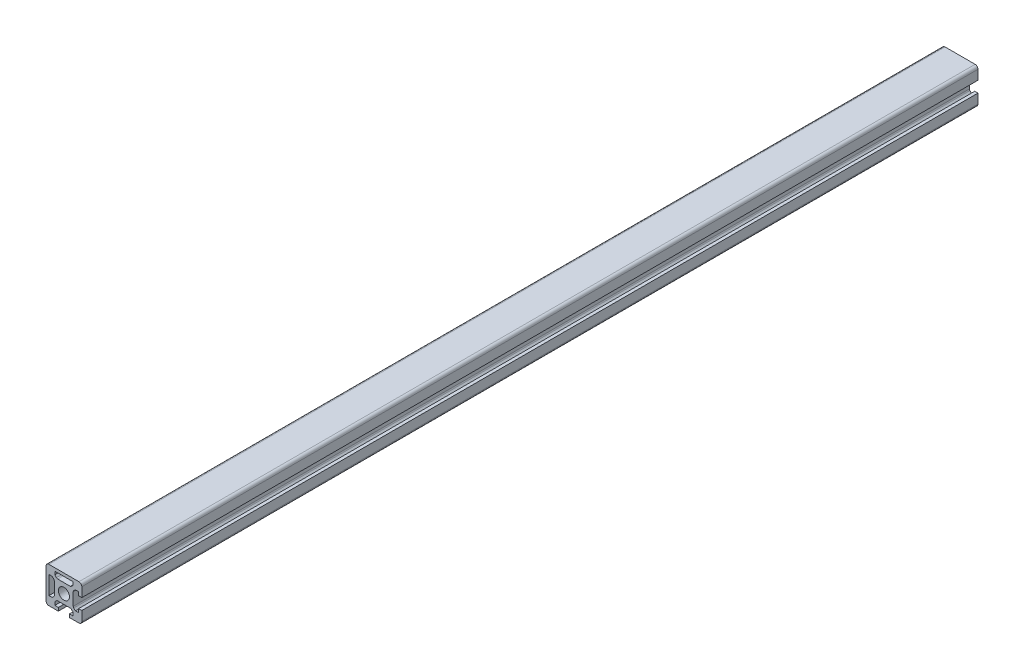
ISO-10303-21;
HEADER;
FILE_DESCRIPTION(('STEP AP214'),'2;1');
FILE_NAME('part.step','',(''),(''),'','','');
FILE_SCHEMA(('AUTOMOTIVE_DESIGN { 1 0 10303 214 1 1 1 1 }'));
ENDSEC;
DATA;
#1=APPLICATION_CONTEXT('core data for automotive mechanical design processes');
#2=APPLICATION_PROTOCOL_DEFINITION('international standard','automotive_design',2000,#1);
#3=PRODUCT_CONTEXT('',#1,'mechanical');
#4=PRODUCT('Part','Part','',(#3));
#5=PRODUCT_RELATED_PRODUCT_CATEGORY('part','',(#4));
#6=PRODUCT_DEFINITION_FORMATION('','',#4);
#7=PRODUCT_DEFINITION_CONTEXT('part definition',#1,'design');
#8=PRODUCT_DEFINITION('design','',#6,#7);
#9=PRODUCT_DEFINITION_SHAPE('','',#8);
#10=(LENGTH_UNIT() NAMED_UNIT(*) SI_UNIT(.MILLI.,.METRE.));
#11=(NAMED_UNIT(*) PLANE_ANGLE_UNIT() SI_UNIT($,.RADIAN.));
#12=(NAMED_UNIT(*) SI_UNIT($,.STERADIAN.) SOLID_ANGLE_UNIT());
#13=UNCERTAINTY_MEASURE_WITH_UNIT(LENGTH_MEASURE(1.E-05),#10,'distance_accuracy_value','');
#14=(GEOMETRIC_REPRESENTATION_CONTEXT(3) GLOBAL_UNCERTAINTY_ASSIGNED_CONTEXT((#13)) GLOBAL_UNIT_ASSIGNED_CONTEXT((#10,
#11,#12)) REPRESENTATION_CONTEXT('',''));
#15=CARTESIAN_POINT('',(0.,0.,0.));
#16=DIRECTION('',(0.,0.,1.));
#17=DIRECTION('',(1.,0.,0.));
#18=AXIS2_PLACEMENT_3D('',#15,#16,#17);
#19=CARTESIAN_POINT('',(-8.4,8.4,-499.));
#20=DIRECTION('',(0.,0.,1.));
#21=DIRECTION('',(1.,0.,0.));
#22=AXIS2_PLACEMENT_3D('',#19,#20,#21);
#23=CYLINDRICAL_SURFACE('',#22,1.6);
#24=CARTESIAN_POINT('',(-8.4,8.4,1.));
#25=DIRECTION('',(0.,0.,1.));
#26=DIRECTION('',(1.,0.,0.));
#27=AXIS2_PLACEMENT_3D('',#24,#25,#26);
#28=CIRCLE('',#27,1.6);
#29=CARTESIAN_POINT('',(-8.4,10.,1.));
#30=VERTEX_POINT('',#29);
#31=CARTESIAN_POINT('',(-10.,8.4,1.));
#32=VERTEX_POINT('',#31);
#33=EDGE_CURVE('E474',#30,#32,#28,.T.);
#34=ORIENTED_EDGE('',*,*,#33,.F.);
#35=DIRECTION('',(0.,0.,1.));
#36=VECTOR('',#35,1.);
#37=CARTESIAN_POINT('',(-8.4,10.,-499.));
#38=LINE('',#37,#36);
#39=CARTESIAN_POINT('',(-8.4,10.,-499.));
#40=VERTEX_POINT('',#39);
#41=EDGE_CURVE('E11',#40,#30,#38,.T.);
#42=ORIENTED_EDGE('',*,*,#41,.F.);
#43=CARTESIAN_POINT('',(-8.4,8.4,-499.));
#44=DIRECTION('',(0.,0.,1.));
#45=DIRECTION('',(1.,0.,0.));
#46=AXIS2_PLACEMENT_3D('',#43,#44,#45);
#47=CIRCLE('',#46,1.6);
#48=CARTESIAN_POINT('',(-10.,8.4,-499.));
#49=VERTEX_POINT('',#48);
#50=EDGE_CURVE('E477',#40,#49,#47,.T.);
#51=ORIENTED_EDGE('',*,*,#50,.T.);
#52=DIRECTION('',(0.,0.,1.));
#53=VECTOR('',#52,1.);
#54=CARTESIAN_POINT('',(-10.,8.4,-499.));
#55=LINE('',#54,#53);
#56=EDGE_CURVE('E36',#49,#32,#55,.T.);
#57=ORIENTED_EDGE('',*,*,#56,.T.);
#58=EDGE_LOOP('',(#34,#42,#51,#57));
#59=FACE_BOUND('',#58,.T.);
#60=ADVANCED_FACE('F33',(#59),#23,.T.);
#61=CARTESIAN_POINT('',(8.4,10.,-499.));
#62=DIRECTION('',(0.,1.,0.));
#63=DIRECTION('',(0.,0.,1.));
#64=AXIS2_PLACEMENT_3D('',#61,#62,#63);
#65=PLANE('',#64);
#66=DIRECTION('',(-1.,0.,0.));
#67=VECTOR('',#66,1.);
#68=CARTESIAN_POINT('',(8.4,10.,1.));
#69=LINE('',#68,#67);
#70=CARTESIAN_POINT('',(8.4,10.,1.));
#71=VERTEX_POINT('',#70);
#72=EDGE_CURVE('E481',#71,#30,#69,.T.);
#73=ORIENTED_EDGE('',*,*,#72,.F.);
#74=DIRECTION('',(0.,0.,1.));
#75=VECTOR('',#74,1.);
#76=CARTESIAN_POINT('',(8.4,10.,-499.));
#77=LINE('',#76,#75);
#78=CARTESIAN_POINT('',(8.4,10.,-499.));
#79=VERTEX_POINT('',#78);
#80=EDGE_CURVE('E41',#79,#71,#77,.T.);
#81=ORIENTED_EDGE('',*,*,#80,.F.);
#82=DIRECTION('',(-1.,0.,0.));
#83=VECTOR('',#82,1.);
#84=CARTESIAN_POINT('',(8.4,10.,-499.));
#85=LINE('',#84,#83);
#86=EDGE_CURVE('E571',#79,#40,#85,.T.);
#87=ORIENTED_EDGE('',*,*,#86,.T.);
#88=ORIENTED_EDGE('',*,*,#41,.T.);
#89=EDGE_LOOP('',(#73,#81,#87,#88));
#90=FACE_BOUND('',#89,.T.);
#91=ADVANCED_FACE('F738',(#90),#65,.T.);
#92=CARTESIAN_POINT('',(8.4,8.4,-499.));
#93=DIRECTION('',(0.,0.,1.));
#94=DIRECTION('',(1.,0.,0.));
#95=AXIS2_PLACEMENT_3D('',#92,#93,#94);
#96=CYLINDRICAL_SURFACE('',#95,1.6);
#97=CARTESIAN_POINT('',(8.4,8.4,1.));
#98=DIRECTION('',(0.,0.,1.));
#99=DIRECTION('',(1.,0.,0.));
#100=AXIS2_PLACEMENT_3D('',#97,#98,#99);
#101=CIRCLE('',#100,1.6);
#102=CARTESIAN_POINT('',(10.,8.4,1.));
#103=VERTEX_POINT('',#102);
#104=EDGE_CURVE('E663',#103,#71,#101,.T.);
#105=ORIENTED_EDGE('',*,*,#104,.F.);
#106=DIRECTION('',(0.,0.,1.));
#107=VECTOR('',#106,1.);
#108=CARTESIAN_POINT('',(10.,8.4,-499.));
#109=LINE('',#108,#107);
#110=CARTESIAN_POINT('',(10.,8.4,-499.));
#111=VERTEX_POINT('',#110);
#112=EDGE_CURVE('E669',#111,#103,#109,.T.);
#113=ORIENTED_EDGE('',*,*,#112,.F.);
#114=CARTESIAN_POINT('',(8.4,8.4,-499.));
#115=DIRECTION('',(0.,0.,1.));
#116=DIRECTION('',(1.,0.,0.));
#117=AXIS2_PLACEMENT_3D('',#114,#115,#116);
#118=CIRCLE('',#117,1.6);
#119=EDGE_CURVE('E568',#111,#79,#118,.T.);
#120=ORIENTED_EDGE('',*,*,#119,.T.);
#121=ORIENTED_EDGE('',*,*,#80,.T.);
#122=EDGE_LOOP('',(#105,#113,#120,#121));
#123=FACE_BOUND('',#122,.T.);
#124=ADVANCED_FACE('F854',(#123),#96,.T.);
#125=CARTESIAN_POINT('',(10.,3.1,-499.));
#126=DIRECTION('',(1.,0.,0.));
#127=DIRECTION('',(0.,0.,-1.));
#128=AXIS2_PLACEMENT_3D('',#125,#126,#127);
#129=PLANE('',#128);
#130=DIRECTION('',(0.,1.,0.));
#131=VECTOR('',#130,1.);
#132=CARTESIAN_POINT('',(10.,3.1,1.));
#133=LINE('',#132,#131);
#134=CARTESIAN_POINT('',(10.,3.1,1.));
#135=VERTEX_POINT('',#134);
#136=EDGE_CURVE('E660',#135,#103,#133,.T.);
#137=ORIENTED_EDGE('',*,*,#136,.F.);
#138=DIRECTION('',(0.,0.,1.));
#139=VECTOR('',#138,1.);
#140=CARTESIAN_POINT('',(10.,3.1,-499.));
#141=LINE('',#140,#139);
#142=CARTESIAN_POINT('',(10.,3.1,-499.));
#143=VERTEX_POINT('',#142);
#144=EDGE_CURVE('E671',#143,#135,#141,.T.);
#145=ORIENTED_EDGE('',*,*,#144,.F.);
#146=DIRECTION('',(0.,1.,0.));
#147=VECTOR('',#146,1.);
#148=CARTESIAN_POINT('',(10.,3.1,-499.));
#149=LINE('',#148,#147);
#150=EDGE_CURVE('E565',#143,#111,#149,.T.);
#151=ORIENTED_EDGE('',*,*,#150,.T.);
#152=ORIENTED_EDGE('',*,*,#112,.T.);
#153=EDGE_LOOP('',(#137,#145,#151,#152));
#154=FACE_BOUND('',#153,.T.);
#155=ADVANCED_FACE('F852',(#154),#129,.T.);
#156=CARTESIAN_POINT('',(8.2,3.1,-499.));
#157=DIRECTION('',(0.,-1.,0.));
#158=DIRECTION('',(0.,0.,-1.));
#159=AXIS2_PLACEMENT_3D('',#156,#157,#158);
#160=PLANE('',#159);
#161=DIRECTION('',(1.,0.,0.));
#162=VECTOR('',#161,1.);
#163=CARTESIAN_POINT('',(8.2,3.1,1.));
#164=LINE('',#163,#162);
#165=CARTESIAN_POINT('',(8.2,3.1,1.));
#166=VERTEX_POINT('',#165);
#167=EDGE_CURVE('E657',#166,#135,#164,.T.);
#168=ORIENTED_EDGE('',*,*,#167,.F.);
#169=DIRECTION('',(0.,0.,1.));
#170=VECTOR('',#169,1.);
#171=CARTESIAN_POINT('',(8.2,3.1,-499.));
#172=LINE('',#171,#170);
#173=CARTESIAN_POINT('',(8.2,3.1,-499.));
#174=VERTEX_POINT('',#173);
#175=EDGE_CURVE('E673',#174,#166,#172,.T.);
#176=ORIENTED_EDGE('',*,*,#175,.F.);
#177=DIRECTION('',(1.,0.,0.));
#178=VECTOR('',#177,1.);
#179=CARTESIAN_POINT('',(8.2,3.1,-499.));
#180=LINE('',#179,#178);
#181=EDGE_CURVE('E562',#174,#143,#180,.T.);
#182=ORIENTED_EDGE('',*,*,#181,.T.);
#183=ORIENTED_EDGE('',*,*,#144,.T.);
#184=EDGE_LOOP('',(#168,#176,#182,#183));
#185=FACE_BOUND('',#184,.T.);
#186=ADVANCED_FACE('F848',(#185),#160,.T.);
#187=CARTESIAN_POINT('',(8.2,5.1,-499.));
#188=DIRECTION('',(-1.,0.,0.));
#189=DIRECTION('',(0.,0.,1.));
#190=AXIS2_PLACEMENT_3D('',#187,#188,#189);
#191=PLANE('',#190);
#192=DIRECTION('',(0.,-1.,0.));
#193=VECTOR('',#192,1.);
#194=CARTESIAN_POINT('',(8.2,5.1,1.));
#195=LINE('',#194,#193);
#196=CARTESIAN_POINT('',(8.2,5.1,1.));
#197=VERTEX_POINT('',#196);
#198=EDGE_CURVE('E654',#197,#166,#195,.T.);
#199=ORIENTED_EDGE('',*,*,#198,.F.);
#200=DIRECTION('',(0.,0.,1.));
#201=VECTOR('',#200,1.);
#202=CARTESIAN_POINT('',(8.2,5.1,-499.));
#203=LINE('',#202,#201);
#204=CARTESIAN_POINT('',(8.2,5.1,-499.));
#205=VERTEX_POINT('',#204);
#206=EDGE_CURVE('E675',#205,#197,#203,.T.);
#207=ORIENTED_EDGE('',*,*,#206,.F.);
#208=DIRECTION('',(0.,-1.,0.));
#209=VECTOR('',#208,1.);
#210=CARTESIAN_POINT('',(8.2,5.1,-499.));
#211=LINE('',#210,#209);
#212=EDGE_CURVE('E559',#205,#174,#211,.T.);
#213=ORIENTED_EDGE('',*,*,#212,.T.);
#214=ORIENTED_EDGE('',*,*,#175,.T.);
#215=EDGE_LOOP('',(#199,#207,#213,#214));
#216=FACE_BOUND('',#215,.T.);
#217=ADVANCED_FACE('F844',(#216),#191,.T.);
#218=CARTESIAN_POINT('',(6.4,5.1,-499.));
#219=DIRECTION('',(0.,-1.,0.));
#220=DIRECTION('',(0.,0.,-1.));
#221=AXIS2_PLACEMENT_3D('',#218,#219,#220);
#222=PLANE('',#221);
#223=DIRECTION('',(1.,0.,0.));
#224=VECTOR('',#223,1.);
#225=CARTESIAN_POINT('',(6.4,5.1,1.));
#226=LINE('',#225,#224);
#227=CARTESIAN_POINT('',(6.4,5.1,1.));
#228=VERTEX_POINT('',#227);
#229=EDGE_CURVE('E651',#228,#197,#226,.T.);
#230=ORIENTED_EDGE('',*,*,#229,.F.);
#231=DIRECTION('',(0.,0.,1.));
#232=VECTOR('',#231,1.);
#233=CARTESIAN_POINT('',(6.4,5.1,-499.));
#234=LINE('',#233,#232);
#235=CARTESIAN_POINT('',(6.4,5.1,-499.));
#236=VERTEX_POINT('',#235);
#237=EDGE_CURVE('E677',#236,#228,#234,.T.);
#238=ORIENTED_EDGE('',*,*,#237,.F.);
#239=DIRECTION('',(1.,0.,0.));
#240=VECTOR('',#239,1.);
#241=CARTESIAN_POINT('',(6.4,5.1,-499.));
#242=LINE('',#241,#240);
#243=EDGE_CURVE('E556',#236,#205,#242,.T.);
#244=ORIENTED_EDGE('',*,*,#243,.T.);
#245=ORIENTED_EDGE('',*,*,#206,.T.);
#246=EDGE_LOOP('',(#230,#238,#244,#245));
#247=FACE_BOUND('',#246,.T.);
#248=ADVANCED_FACE('F840',(#247),#222,.T.);
#249=CARTESIAN_POINT('',(5.49289321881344,4.19289321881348,-499.));
#250=DIRECTION('',(0.707106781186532,-0.707106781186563,0.));
#251=DIRECTION('',(0.707106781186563,0.707106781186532,0.));
#252=AXIS2_PLACEMENT_3D('',#249,#250,#251);
#253=PLANE('',#252);
#254=DIRECTION('',(0.707106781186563,0.707106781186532,0.));
#255=VECTOR('',#254,1.);
#256=CARTESIAN_POINT('',(5.49289321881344,4.19289321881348,1.));
#257=LINE('',#256,#255);
#258=CARTESIAN_POINT('',(5.49289321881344,4.19289321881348,1.));
#259=VERTEX_POINT('',#258);
#260=EDGE_CURVE('E648',#259,#228,#257,.T.);
#261=ORIENTED_EDGE('',*,*,#260,.F.);
#262=DIRECTION('',(0.,0.,1.));
#263=VECTOR('',#262,1.);
#264=CARTESIAN_POINT('',(5.49289321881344,4.19289321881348,-499.));
#265=LINE('',#264,#263);
#266=CARTESIAN_POINT('',(5.49289321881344,4.19289321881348,-499.));
#267=VERTEX_POINT('',#266);
#268=EDGE_CURVE('E679',#267,#259,#265,.T.);
#269=ORIENTED_EDGE('',*,*,#268,.F.);
#270=DIRECTION('',(0.707106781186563,0.707106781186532,0.));
#271=VECTOR('',#270,1.);
#272=CARTESIAN_POINT('',(5.49289321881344,4.19289321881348,-499.));
#273=LINE('',#272,#271);
#274=EDGE_CURVE('E553',#267,#236,#273,.T.);
#275=ORIENTED_EDGE('',*,*,#274,.T.);
#276=ORIENTED_EDGE('',*,*,#237,.T.);
#277=EDGE_LOOP('',(#261,#269,#275,#276));
#278=FACE_BOUND('',#277,.T.);
#279=ADVANCED_FACE('F836',(#278),#253,.T.);
#280=CARTESIAN_POINT('',(6.2,3.48578643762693,-499.));
#281=DIRECTION('',(0.,0.,1.));
#282=DIRECTION('',(1.,0.,0.));
#283=AXIS2_PLACEMENT_3D('',#280,#281,#282);
#284=CYLINDRICAL_SURFACE('',#283,1.00000000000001);
#285=CARTESIAN_POINT('',(6.2,3.48578643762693,1.));
#286=DIRECTION('',(0.,0.,-1.));
#287=DIRECTION('',(-1.,0.,0.));
#288=AXIS2_PLACEMENT_3D('',#285,#286,#287);
#289=CIRCLE('',#288,1.00000000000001);
#290=CARTESIAN_POINT('',(5.19999999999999,3.48578643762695,1.));
#291=VERTEX_POINT('',#290);
#292=EDGE_CURVE('E645',#291,#259,#289,.T.);
#293=ORIENTED_EDGE('',*,*,#292,.F.);
#294=DIRECTION('',(0.,0.,1.));
#295=VECTOR('',#294,1.);
#296=CARTESIAN_POINT('',(5.19999999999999,3.48578643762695,-499.));
#297=LINE('',#296,#295);
#298=CARTESIAN_POINT('',(5.19999999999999,3.48578643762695,-499.));
#299=VERTEX_POINT('',#298);
#300=EDGE_CURVE('E681',#299,#291,#297,.T.);
#301=ORIENTED_EDGE('',*,*,#300,.F.);
#302=CARTESIAN_POINT('',(6.2,3.48578643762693,-499.));
#303=DIRECTION('',(0.,0.,-1.));
#304=DIRECTION('',(-1.,0.,0.));
#305=AXIS2_PLACEMENT_3D('',#302,#303,#304);
#306=CIRCLE('',#305,1.00000000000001);
#307=EDGE_CURVE('E550',#299,#267,#306,.T.);
#308=ORIENTED_EDGE('',*,*,#307,.T.);
#309=ORIENTED_EDGE('',*,*,#268,.T.);
#310=EDGE_LOOP('',(#293,#301,#308,#309));
#311=FACE_BOUND('',#310,.T.);
#312=ADVANCED_FACE('F832',(#311),#284,.F.);
#313=CARTESIAN_POINT('',(5.2,-3.48578643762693,-499.));
#314=DIRECTION('',(1.,0.,0.));
#315=DIRECTION('',(0.,0.,-1.));
#316=AXIS2_PLACEMENT_3D('',#313,#314,#315);
#317=PLANE('',#316);
#318=DIRECTION('',(0.,1.,0.));
#319=VECTOR('',#318,1.);
#320=CARTESIAN_POINT('',(5.2,-3.48578643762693,1.));
#321=LINE('',#320,#319);
#322=CARTESIAN_POINT('',(5.2,-3.48578643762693,1.));
#323=VERTEX_POINT('',#322);
#324=EDGE_CURVE('E642',#323,#291,#321,.T.);
#325=ORIENTED_EDGE('',*,*,#324,.F.);
#326=DIRECTION('',(0.,0.,1.));
#327=VECTOR('',#326,1.);
#328=CARTESIAN_POINT('',(5.2,-3.48578643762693,-499.));
#329=LINE('',#328,#327);
#330=CARTESIAN_POINT('',(5.2,-3.48578643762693,-499.));
#331=VERTEX_POINT('',#330);
#332=EDGE_CURVE('E683',#331,#323,#329,.T.);
#333=ORIENTED_EDGE('',*,*,#332,.F.);
#334=DIRECTION('',(0.,1.,0.));
#335=VECTOR('',#334,1.);
#336=CARTESIAN_POINT('',(5.2,-3.48578643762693,-499.));
#337=LINE('',#336,#335);
#338=EDGE_CURVE('E547',#331,#299,#337,.T.);
#339=ORIENTED_EDGE('',*,*,#338,.T.);
#340=ORIENTED_EDGE('',*,*,#300,.T.);
#341=EDGE_LOOP('',(#325,#333,#339,#340));
#342=FACE_BOUND('',#341,.T.);
#343=ADVANCED_FACE('F828',(#342),#317,.T.);
#344=CARTESIAN_POINT('',(6.2,-3.48578643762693,-499.));
#345=DIRECTION('',(0.,0.,1.));
#346=DIRECTION('',(1.,0.,0.));
#347=AXIS2_PLACEMENT_3D('',#344,#345,#346);
#348=CYLINDRICAL_SURFACE('',#347,1.);
#349=CARTESIAN_POINT('',(6.2,-3.48578643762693,1.));
#350=DIRECTION('',(0.,0.,-1.));
#351=DIRECTION('',(-1.,0.,0.));
#352=AXIS2_PLACEMENT_3D('',#349,#350,#351);
#353=CIRCLE('',#352,1.);
#354=CARTESIAN_POINT('',(5.49289321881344,-4.19289321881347,1.));
#355=VERTEX_POINT('',#354);
#356=EDGE_CURVE('E639',#355,#323,#353,.T.);
#357=ORIENTED_EDGE('',*,*,#356,.F.);
#358=DIRECTION('',(0.,0.,1.));
#359=VECTOR('',#358,1.);
#360=CARTESIAN_POINT('',(5.49289321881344,-4.19289321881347,-499.));
#361=LINE('',#360,#359);
#362=CARTESIAN_POINT('',(5.49289321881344,-4.19289321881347,-499.));
#363=VERTEX_POINT('',#362);
#364=EDGE_CURVE('E685',#363,#355,#361,.T.);
#365=ORIENTED_EDGE('',*,*,#364,.F.);
#366=CARTESIAN_POINT('',(6.2,-3.48578643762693,-499.));
#367=DIRECTION('',(0.,0.,-1.));
#368=DIRECTION('',(-1.,0.,0.));
#369=AXIS2_PLACEMENT_3D('',#366,#367,#368);
#370=CIRCLE('',#369,1.);
#371=EDGE_CURVE('E544',#363,#331,#370,.T.);
#372=ORIENTED_EDGE('',*,*,#371,.T.);
#373=ORIENTED_EDGE('',*,*,#332,.T.);
#374=EDGE_LOOP('',(#357,#365,#372,#373));
#375=FACE_BOUND('',#374,.T.);
#376=ADVANCED_FACE('F824',(#375),#348,.F.);
#377=CARTESIAN_POINT('',(6.4,-5.1,-499.));
#378=DIRECTION('',(0.707106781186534,0.707106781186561,0.));
#379=DIRECTION('',(-0.707106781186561,0.707106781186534,0.));
#380=AXIS2_PLACEMENT_3D('',#377,#378,#379);
#381=PLANE('',#380);
#382=DIRECTION('',(-0.707106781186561,0.707106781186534,0.));
#383=VECTOR('',#382,1.);
#384=CARTESIAN_POINT('',(6.4,-5.1,1.));
#385=LINE('',#384,#383);
#386=CARTESIAN_POINT('',(6.4,-5.1,1.));
#387=VERTEX_POINT('',#386);
#388=EDGE_CURVE('E636',#387,#355,#385,.T.);
#389=ORIENTED_EDGE('',*,*,#388,.F.);
#390=DIRECTION('',(0.,0.,1.));
#391=VECTOR('',#390,1.);
#392=CARTESIAN_POINT('',(6.4,-5.1,-499.));
#393=LINE('',#392,#391);
#394=CARTESIAN_POINT('',(6.4,-5.1,-499.));
#395=VERTEX_POINT('',#394);
#396=EDGE_CURVE('E687',#395,#387,#393,.T.);
#397=ORIENTED_EDGE('',*,*,#396,.F.);
#398=DIRECTION('',(-0.707106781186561,0.707106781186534,0.));
#399=VECTOR('',#398,1.);
#400=CARTESIAN_POINT('',(6.4,-5.1,-499.));
#401=LINE('',#400,#399);
#402=EDGE_CURVE('E541',#395,#363,#401,.T.);
#403=ORIENTED_EDGE('',*,*,#402,.T.);
#404=ORIENTED_EDGE('',*,*,#364,.T.);
#405=EDGE_LOOP('',(#389,#397,#403,#404));
#406=FACE_BOUND('',#405,.T.);
#407=ADVANCED_FACE('F820',(#406),#381,.T.);
#408=CARTESIAN_POINT('',(8.2,-5.1,-499.));
#409=DIRECTION('',(0.,1.,0.));
#410=DIRECTION('',(0.,0.,1.));
#411=AXIS2_PLACEMENT_3D('',#408,#409,#410);
#412=PLANE('',#411);
#413=DIRECTION('',(-1.,0.,0.));
#414=VECTOR('',#413,1.);
#415=CARTESIAN_POINT('',(8.2,-5.1,1.));
#416=LINE('',#415,#414);
#417=CARTESIAN_POINT('',(8.2,-5.1,1.));
#418=VERTEX_POINT('',#417);
#419=EDGE_CURVE('E633',#418,#387,#416,.T.);
#420=ORIENTED_EDGE('',*,*,#419,.F.);
#421=DIRECTION('',(0.,0.,1.));
#422=VECTOR('',#421,1.);
#423=CARTESIAN_POINT('',(8.2,-5.1,-499.));
#424=LINE('',#423,#422);
#425=CARTESIAN_POINT('',(8.2,-5.1,-499.));
#426=VERTEX_POINT('',#425);
#427=EDGE_CURVE('E689',#426,#418,#424,.T.);
#428=ORIENTED_EDGE('',*,*,#427,.F.);
#429=DIRECTION('',(-1.,0.,0.));
#430=VECTOR('',#429,1.);
#431=CARTESIAN_POINT('',(8.2,-5.1,-499.));
#432=LINE('',#431,#430);
#433=EDGE_CURVE('E538',#426,#395,#432,.T.);
#434=ORIENTED_EDGE('',*,*,#433,.T.);
#435=ORIENTED_EDGE('',*,*,#396,.T.);
#436=EDGE_LOOP('',(#420,#428,#434,#435));
#437=FACE_BOUND('',#436,.T.);
#438=ADVANCED_FACE('F816',(#437),#412,.T.);
#439=CARTESIAN_POINT('',(8.2,-3.1,-499.));
#440=DIRECTION('',(-1.,0.,0.));
#441=DIRECTION('',(0.,0.,1.));
#442=AXIS2_PLACEMENT_3D('',#439,#440,#441);
#443=PLANE('',#442);
#444=DIRECTION('',(0.,-1.,0.));
#445=VECTOR('',#444,1.);
#446=CARTESIAN_POINT('',(8.2,-3.1,1.));
#447=LINE('',#446,#445);
#448=CARTESIAN_POINT('',(8.2,-3.1,1.));
#449=VERTEX_POINT('',#448);
#450=EDGE_CURVE('E630',#449,#418,#447,.T.);
#451=ORIENTED_EDGE('',*,*,#450,.F.);
#452=DIRECTION('',(0.,0.,1.));
#453=VECTOR('',#452,1.);
#454=CARTESIAN_POINT('',(8.2,-3.1,-499.));
#455=LINE('',#454,#453);
#456=CARTESIAN_POINT('',(8.2,-3.1,-499.));
#457=VERTEX_POINT('',#456);
#458=EDGE_CURVE('E691',#457,#449,#455,.T.);
#459=ORIENTED_EDGE('',*,*,#458,.F.);
#460=DIRECTION('',(0.,-1.,0.));
#461=VECTOR('',#460,1.);
#462=CARTESIAN_POINT('',(8.2,-3.1,-499.));
#463=LINE('',#462,#461);
#464=EDGE_CURVE('E535',#457,#426,#463,.T.);
#465=ORIENTED_EDGE('',*,*,#464,.T.);
#466=ORIENTED_EDGE('',*,*,#427,.T.);
#467=EDGE_LOOP('',(#451,#459,#465,#466));
#468=FACE_BOUND('',#467,.T.);
#469=ADVANCED_FACE('F812',(#468),#443,.T.);
#470=CARTESIAN_POINT('',(10.,-3.1,-499.));
#471=DIRECTION('',(0.,1.,0.));
#472=DIRECTION('',(0.,0.,1.));
#473=AXIS2_PLACEMENT_3D('',#470,#471,#472);
#474=PLANE('',#473);
#475=DIRECTION('',(-1.,0.,0.));
#476=VECTOR('',#475,1.);
#477=CARTESIAN_POINT('',(10.,-3.1,1.));
#478=LINE('',#477,#476);
#479=CARTESIAN_POINT('',(10.,-3.1,1.));
#480=VERTEX_POINT('',#479);
#481=EDGE_CURVE('E627',#480,#449,#478,.T.);
#482=ORIENTED_EDGE('',*,*,#481,.F.);
#483=DIRECTION('',(0.,0.,1.));
#484=VECTOR('',#483,1.);
#485=CARTESIAN_POINT('',(10.,-3.1,-499.));
#486=LINE('',#485,#484);
#487=CARTESIAN_POINT('',(10.,-3.1,-499.));
#488=VERTEX_POINT('',#487);
#489=EDGE_CURVE('E693',#488,#480,#486,.T.);
#490=ORIENTED_EDGE('',*,*,#489,.F.);
#491=DIRECTION('',(-1.,0.,0.));
#492=VECTOR('',#491,1.);
#493=CARTESIAN_POINT('',(10.,-3.1,-499.));
#494=LINE('',#493,#492);
#495=EDGE_CURVE('E532',#488,#457,#494,.T.);
#496=ORIENTED_EDGE('',*,*,#495,.T.);
#497=ORIENTED_EDGE('',*,*,#458,.T.);
#498=EDGE_LOOP('',(#482,#490,#496,#497));
#499=FACE_BOUND('',#498,.T.);
#500=ADVANCED_FACE('F808',(#499),#474,.T.);
#501=CARTESIAN_POINT('',(10.,-8.4,-499.));
#502=DIRECTION('',(1.,0.,0.));
#503=DIRECTION('',(0.,0.,-1.));
#504=AXIS2_PLACEMENT_3D('',#501,#502,#503);
#505=PLANE('',#504);
#506=DIRECTION('',(0.,1.,0.));
#507=VECTOR('',#506,1.);
#508=CARTESIAN_POINT('',(10.,-8.4,1.));
#509=LINE('',#508,#507);
#510=CARTESIAN_POINT('',(10.,-8.4,1.));
#511=VERTEX_POINT('',#510);
#512=EDGE_CURVE('E624',#511,#480,#509,.T.);
#513=ORIENTED_EDGE('',*,*,#512,.F.);
#514=DIRECTION('',(0.,0.,1.));
#515=VECTOR('',#514,1.);
#516=CARTESIAN_POINT('',(10.,-8.4,-499.));
#517=LINE('',#516,#515);
#518=CARTESIAN_POINT('',(10.,-8.4,-499.));
#519=VERTEX_POINT('',#518);
#520=EDGE_CURVE('E695',#519,#511,#517,.T.);
#521=ORIENTED_EDGE('',*,*,#520,.F.);
#522=DIRECTION('',(0.,1.,0.));
#523=VECTOR('',#522,1.);
#524=CARTESIAN_POINT('',(10.,-8.4,-499.));
#525=LINE('',#524,#523);
#526=EDGE_CURVE('E529',#519,#488,#525,.T.);
#527=ORIENTED_EDGE('',*,*,#526,.T.);
#528=ORIENTED_EDGE('',*,*,#489,.T.);
#529=EDGE_LOOP('',(#513,#521,#527,#528));
#530=FACE_BOUND('',#529,.T.);
#531=ADVANCED_FACE('F804',(#530),#505,.T.);
#532=CARTESIAN_POINT('',(8.4,-8.4,-499.));
#533=DIRECTION('',(0.,0.,1.));
#534=DIRECTION('',(1.,0.,0.));
#535=AXIS2_PLACEMENT_3D('',#532,#533,#534);
#536=CYLINDRICAL_SURFACE('',#535,1.6);
#537=CARTESIAN_POINT('',(8.4,-8.4,1.));
#538=DIRECTION('',(0.,0.,1.));
#539=DIRECTION('',(1.,0.,0.));
#540=AXIS2_PLACEMENT_3D('',#537,#538,#539);
#541=CIRCLE('',#540,1.6);
#542=CARTESIAN_POINT('',(8.4,-10.,1.));
#543=VERTEX_POINT('',#542);
#544=EDGE_CURVE('E621',#543,#511,#541,.T.);
#545=ORIENTED_EDGE('',*,*,#544,.F.);
#546=DIRECTION('',(0.,0.,1.));
#547=VECTOR('',#546,1.);
#548=CARTESIAN_POINT('',(8.4,-10.,-499.));
#549=LINE('',#548,#547);
#550=CARTESIAN_POINT('',(8.4,-10.,-499.));
#551=VERTEX_POINT('',#550);
#552=EDGE_CURVE('E697',#551,#543,#549,.T.);
#553=ORIENTED_EDGE('',*,*,#552,.F.);
#554=CARTESIAN_POINT('',(8.4,-8.4,-499.));
#555=DIRECTION('',(0.,0.,1.));
#556=DIRECTION('',(1.,0.,0.));
#557=AXIS2_PLACEMENT_3D('',#554,#555,#556);
#558=CIRCLE('',#557,1.6);
#559=EDGE_CURVE('E526',#551,#519,#558,.T.);
#560=ORIENTED_EDGE('',*,*,#559,.T.);
#561=ORIENTED_EDGE('',*,*,#520,.T.);
#562=EDGE_LOOP('',(#545,#553,#560,#561));
#563=FACE_BOUND('',#562,.T.);
#564=ADVANCED_FACE('F800',(#563),#536,.T.);
#565=CARTESIAN_POINT('',(3.1,-10.,-499.));
#566=DIRECTION('',(0.,-1.,0.));
#567=DIRECTION('',(0.,0.,-1.));
#568=AXIS2_PLACEMENT_3D('',#565,#566,#567);
#569=PLANE('',#568);
#570=DIRECTION('',(1.,0.,0.));
#571=VECTOR('',#570,1.);
#572=CARTESIAN_POINT('',(3.1,-10.,1.));
#573=LINE('',#572,#571);
#574=CARTESIAN_POINT('',(3.1,-10.,1.));
#575=VERTEX_POINT('',#574);
#576=EDGE_CURVE('E618',#575,#543,#573,.T.);
#577=ORIENTED_EDGE('',*,*,#576,.F.);
#578=DIRECTION('',(0.,0.,1.));
#579=VECTOR('',#578,1.);
#580=CARTESIAN_POINT('',(3.1,-10.,-499.));
#581=LINE('',#580,#579);
#582=CARTESIAN_POINT('',(3.1,-10.,-499.));
#583=VERTEX_POINT('',#582);
#584=EDGE_CURVE('E699',#583,#575,#581,.T.);
#585=ORIENTED_EDGE('',*,*,#584,.F.);
#586=DIRECTION('',(1.,0.,0.));
#587=VECTOR('',#586,1.);
#588=CARTESIAN_POINT('',(3.1,-10.,-499.));
#589=LINE('',#588,#587);
#590=EDGE_CURVE('E523',#583,#551,#589,.T.);
#591=ORIENTED_EDGE('',*,*,#590,.T.);
#592=ORIENTED_EDGE('',*,*,#552,.T.);
#593=EDGE_LOOP('',(#577,#585,#591,#592));
#594=FACE_BOUND('',#593,.T.);
#595=ADVANCED_FACE('F796',(#594),#569,.T.);
#596=CARTESIAN_POINT('',(3.1,-8.2,-499.));
#597=DIRECTION('',(-1.,0.,0.));
#598=DIRECTION('',(0.,0.,1.));
#599=AXIS2_PLACEMENT_3D('',#596,#597,#598);
#600=PLANE('',#599);
#601=DIRECTION('',(0.,-1.,0.));
#602=VECTOR('',#601,1.);
#603=CARTESIAN_POINT('',(3.1,-8.2,1.));
#604=LINE('',#603,#602);
#605=CARTESIAN_POINT('',(3.1,-8.2,1.));
#606=VERTEX_POINT('',#605);
#607=EDGE_CURVE('E615',#606,#575,#604,.T.);
#608=ORIENTED_EDGE('',*,*,#607,.F.);
#609=DIRECTION('',(0.,0.,1.));
#610=VECTOR('',#609,1.);
#611=CARTESIAN_POINT('',(3.1,-8.2,-499.));
#612=LINE('',#611,#610);
#613=CARTESIAN_POINT('',(3.1,-8.2,-499.));
#614=VERTEX_POINT('',#613);
#615=EDGE_CURVE('E701',#614,#606,#612,.T.);
#616=ORIENTED_EDGE('',*,*,#615,.F.);
#617=DIRECTION('',(0.,-1.,0.));
#618=VECTOR('',#617,1.);
#619=CARTESIAN_POINT('',(3.1,-8.2,-499.));
#620=LINE('',#619,#618);
#621=EDGE_CURVE('E520',#614,#583,#620,.T.);
#622=ORIENTED_EDGE('',*,*,#621,.T.);
#623=ORIENTED_EDGE('',*,*,#584,.T.);
#624=EDGE_LOOP('',(#608,#616,#622,#623));
#625=FACE_BOUND('',#624,.T.);
#626=ADVANCED_FACE('F792',(#625),#600,.T.);
#627=CARTESIAN_POINT('',(5.1,-8.2,-499.));
#628=DIRECTION('',(0.,1.,0.));
#629=DIRECTION('',(0.,0.,1.));
#630=AXIS2_PLACEMENT_3D('',#627,#628,#629);
#631=PLANE('',#630);
#632=DIRECTION('',(-1.,0.,0.));
#633=VECTOR('',#632,1.);
#634=CARTESIAN_POINT('',(5.1,-8.2,1.));
#635=LINE('',#634,#633);
#636=CARTESIAN_POINT('',(5.1,-8.2,1.));
#637=VERTEX_POINT('',#636);
#638=EDGE_CURVE('E612',#637,#606,#635,.T.);
#639=ORIENTED_EDGE('',*,*,#638,.F.);
#640=DIRECTION('',(0.,0.,1.));
#641=VECTOR('',#640,1.);
#642=CARTESIAN_POINT('',(5.1,-8.2,-499.));
#643=LINE('',#642,#641);
#644=CARTESIAN_POINT('',(5.1,-8.2,-499.));
#645=VERTEX_POINT('',#644);
#646=EDGE_CURVE('E703',#645,#637,#643,.T.);
#647=ORIENTED_EDGE('',*,*,#646,.F.);
#648=DIRECTION('',(-1.,0.,0.));
#649=VECTOR('',#648,1.);
#650=CARTESIAN_POINT('',(5.1,-8.2,-499.));
#651=LINE('',#650,#649);
#652=EDGE_CURVE('E517',#645,#614,#651,.T.);
#653=ORIENTED_EDGE('',*,*,#652,.T.);
#654=ORIENTED_EDGE('',*,*,#615,.T.);
#655=EDGE_LOOP('',(#639,#647,#653,#654));
#656=FACE_BOUND('',#655,.T.);
#657=ADVANCED_FACE('F788',(#656),#631,.T.);
#658=CARTESIAN_POINT('',(5.1,-6.4,-499.));
#659=DIRECTION('',(-1.,0.,0.));
#660=DIRECTION('',(0.,0.,1.));
#661=AXIS2_PLACEMENT_3D('',#658,#659,#660);
#662=PLANE('',#661);
#663=DIRECTION('',(0.,-1.,0.));
#664=VECTOR('',#663,1.);
#665=CARTESIAN_POINT('',(5.1,-6.4,1.));
#666=LINE('',#665,#664);
#667=CARTESIAN_POINT('',(5.1,-6.4,1.));
#668=VERTEX_POINT('',#667);
#669=EDGE_CURVE('E609',#668,#637,#666,.T.);
#670=ORIENTED_EDGE('',*,*,#669,.F.);
#671=DIRECTION('',(0.,0.,1.));
#672=VECTOR('',#671,1.);
#673=CARTESIAN_POINT('',(5.1,-6.4,-499.));
#674=LINE('',#673,#672);
#675=CARTESIAN_POINT('',(5.1,-6.4,-499.));
#676=VERTEX_POINT('',#675);
#677=EDGE_CURVE('E705',#676,#668,#674,.T.);
#678=ORIENTED_EDGE('',*,*,#677,.F.);
#679=DIRECTION('',(0.,-1.,0.));
#680=VECTOR('',#679,1.);
#681=CARTESIAN_POINT('',(5.1,-6.4,-499.));
#682=LINE('',#681,#680);
#683=EDGE_CURVE('E514',#676,#645,#682,.T.);
#684=ORIENTED_EDGE('',*,*,#683,.T.);
#685=ORIENTED_EDGE('',*,*,#646,.T.);
#686=EDGE_LOOP('',(#670,#678,#684,#685));
#687=FACE_BOUND('',#686,.T.);
#688=ADVANCED_FACE('F784',(#687),#662,.T.);
#689=CARTESIAN_POINT('',(4.19289321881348,-5.49289321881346,-499.));
#690=DIRECTION('',(-0.707106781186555,-0.70710678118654,0.));
#691=DIRECTION('',(0.70710678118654,-0.707106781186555,0.));
#692=AXIS2_PLACEMENT_3D('',#689,#690,#691);
#693=PLANE('',#692);
#694=DIRECTION('',(0.70710678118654,-0.707106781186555,0.));
#695=VECTOR('',#694,1.);
#696=CARTESIAN_POINT('',(4.19289321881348,-5.49289321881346,1.));
#697=LINE('',#696,#695);
#698=CARTESIAN_POINT('',(4.19289321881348,-5.49289321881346,1.));
#699=VERTEX_POINT('',#698);
#700=EDGE_CURVE('E606',#699,#668,#697,.T.);
#701=ORIENTED_EDGE('',*,*,#700,.F.);
#702=DIRECTION('',(0.,0.,1.));
#703=VECTOR('',#702,1.);
#704=CARTESIAN_POINT('',(4.19289321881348,-5.49289321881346,-499.));
#705=LINE('',#704,#703);
#706=CARTESIAN_POINT('',(4.19289321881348,-5.49289321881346,-499.));
#707=VERTEX_POINT('',#706);
#708=EDGE_CURVE('E707',#707,#699,#705,.T.);
#709=ORIENTED_EDGE('',*,*,#708,.F.);
#710=DIRECTION('',(0.70710678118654,-0.707106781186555,0.));
#711=VECTOR('',#710,1.);
#712=CARTESIAN_POINT('',(4.19289321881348,-5.49289321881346,-499.));
#713=LINE('',#712,#711);
#714=EDGE_CURVE('E511',#707,#676,#713,.T.);
#715=ORIENTED_EDGE('',*,*,#714,.T.);
#716=ORIENTED_EDGE('',*,*,#677,.T.);
#717=EDGE_LOOP('',(#701,#709,#715,#716));
#718=FACE_BOUND('',#717,.T.);
#719=ADVANCED_FACE('F780',(#718),#693,.T.);
#720=CARTESIAN_POINT('',(3.48578643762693,-6.2,-499.));
#721=DIRECTION('',(0.,0.,1.));
#722=DIRECTION('',(1.,0.,0.));
#723=AXIS2_PLACEMENT_3D('',#720,#721,#722);
#724=CYLINDRICAL_SURFACE('',#723,0.999999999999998);
#725=CARTESIAN_POINT('',(3.48578643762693,-6.2,1.));
#726=DIRECTION('',(0.,0.,-1.));
#727=DIRECTION('',(-1.,0.,0.));
#728=AXIS2_PLACEMENT_3D('',#725,#726,#727);
#729=CIRCLE('',#728,0.999999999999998);
#730=CARTESIAN_POINT('',(3.48578643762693,-5.2,1.));
#731=VERTEX_POINT('',#730);
#732=EDGE_CURVE('E603',#731,#699,#729,.T.);
#733=ORIENTED_EDGE('',*,*,#732,.F.);
#734=DIRECTION('',(0.,0.,1.));
#735=VECTOR('',#734,1.);
#736=CARTESIAN_POINT('',(3.48578643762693,-5.2,-499.));
#737=LINE('',#736,#735);
#738=CARTESIAN_POINT('',(3.48578643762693,-5.2,-499.));
#739=VERTEX_POINT('',#738);
#740=EDGE_CURVE('E709',#739,#731,#737,.T.);
#741=ORIENTED_EDGE('',*,*,#740,.F.);
#742=CARTESIAN_POINT('',(3.48578643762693,-6.2,-499.));
#743=DIRECTION('',(0.,0.,-1.));
#744=DIRECTION('',(-1.,0.,0.));
#745=AXIS2_PLACEMENT_3D('',#742,#743,#744);
#746=CIRCLE('',#745,0.999999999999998);
#747=EDGE_CURVE('E508',#739,#707,#746,.T.);
#748=ORIENTED_EDGE('',*,*,#747,.T.);
#749=ORIENTED_EDGE('',*,*,#708,.T.);
#750=EDGE_LOOP('',(#733,#741,#748,#749));
#751=FACE_BOUND('',#750,.T.);
#752=ADVANCED_FACE('F776',(#751),#724,.F.);
#753=CARTESIAN_POINT('',(-3.48578643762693,-5.2,-499.));
#754=DIRECTION('',(0.,-1.,0.));
#755=DIRECTION('',(0.,0.,-1.));
#756=AXIS2_PLACEMENT_3D('',#753,#754,#755);
#757=PLANE('',#756);
#758=DIRECTION('',(1.,0.,0.));
#759=VECTOR('',#758,1.);
#760=CARTESIAN_POINT('',(-3.48578643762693,-5.2,1.));
#761=LINE('',#760,#759);
#762=CARTESIAN_POINT('',(-3.48578643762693,-5.2,1.));
#763=VERTEX_POINT('',#762);
#764=EDGE_CURVE('E600',#763,#731,#761,.T.);
#765=ORIENTED_EDGE('',*,*,#764,.F.);
#766=DIRECTION('',(0.,0.,1.));
#767=VECTOR('',#766,1.);
#768=CARTESIAN_POINT('',(-3.48578643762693,-5.2,-499.));
#769=LINE('',#768,#767);
#770=CARTESIAN_POINT('',(-3.48578643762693,-5.2,-499.));
#771=VERTEX_POINT('',#770);
#772=EDGE_CURVE('E711',#771,#763,#769,.T.);
#773=ORIENTED_EDGE('',*,*,#772,.F.);
#774=DIRECTION('',(1.,0.,0.));
#775=VECTOR('',#774,1.);
#776=CARTESIAN_POINT('',(-3.48578643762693,-5.2,-499.));
#777=LINE('',#776,#775);
#778=EDGE_CURVE('E505',#771,#739,#777,.T.);
#779=ORIENTED_EDGE('',*,*,#778,.T.);
#780=ORIENTED_EDGE('',*,*,#740,.T.);
#781=EDGE_LOOP('',(#765,#773,#779,#780));
#782=FACE_BOUND('',#781,.T.);
#783=ADVANCED_FACE('F772',(#782),#757,.T.);
#784=CARTESIAN_POINT('',(-3.48578643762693,-6.2,-499.));
#785=DIRECTION('',(0.,0.,1.));
#786=DIRECTION('',(1.,0.,0.));
#787=AXIS2_PLACEMENT_3D('',#784,#785,#786);
#788=CYLINDRICAL_SURFACE('',#787,1.00000000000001);
#789=CARTESIAN_POINT('',(-3.48578643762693,-6.2,1.));
#790=DIRECTION('',(0.,0.,-1.));
#791=DIRECTION('',(-1.,0.,0.));
#792=AXIS2_PLACEMENT_3D('',#789,#790,#791);
#793=CIRCLE('',#792,1.00000000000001);
#794=CARTESIAN_POINT('',(-4.19289321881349,-5.49289321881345,1.));
#795=VERTEX_POINT('',#794);
#796=EDGE_CURVE('E597',#795,#763,#793,.T.);
#797=ORIENTED_EDGE('',*,*,#796,.F.);
#798=DIRECTION('',(0.,0.,1.));
#799=VECTOR('',#798,1.);
#800=CARTESIAN_POINT('',(-4.19289321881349,-5.49289321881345,-499.));
#801=LINE('',#800,#799);
#802=CARTESIAN_POINT('',(-4.19289321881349,-5.49289321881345,-499.));
#803=VERTEX_POINT('',#802);
#804=EDGE_CURVE('E713',#803,#795,#801,.T.);
#805=ORIENTED_EDGE('',*,*,#804,.F.);
#806=CARTESIAN_POINT('',(-3.48578643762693,-6.2,-499.));
#807=DIRECTION('',(0.,0.,-1.));
#808=DIRECTION('',(-1.,0.,0.));
#809=AXIS2_PLACEMENT_3D('',#806,#807,#808);
#810=CIRCLE('',#809,1.00000000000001);
#811=EDGE_CURVE('E502',#803,#771,#810,.T.);
#812=ORIENTED_EDGE('',*,*,#811,.T.);
#813=ORIENTED_EDGE('',*,*,#772,.T.);
#814=EDGE_LOOP('',(#797,#805,#812,#813));
#815=FACE_BOUND('',#814,.T.);
#816=ADVANCED_FACE('F768',(#815),#788,.F.);
#817=CARTESIAN_POINT('',(-5.1,-6.4,-499.));
#818=DIRECTION('',(0.707106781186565,-0.70710678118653,0.));
#819=DIRECTION('',(0.70710678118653,0.707106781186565,0.));
#820=AXIS2_PLACEMENT_3D('',#817,#818,#819);
#821=PLANE('',#820);
#822=DIRECTION('',(0.70710678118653,0.707106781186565,0.));
#823=VECTOR('',#822,1.);
#824=CARTESIAN_POINT('',(-5.1,-6.4,1.));
#825=LINE('',#824,#823);
#826=CARTESIAN_POINT('',(-5.1,-6.4,1.));
#827=VERTEX_POINT('',#826);
#828=EDGE_CURVE('E594',#827,#795,#825,.T.);
#829=ORIENTED_EDGE('',*,*,#828,.F.);
#830=DIRECTION('',(0.,0.,1.));
#831=VECTOR('',#830,1.);
#832=CARTESIAN_POINT('',(-5.1,-6.4,-499.));
#833=LINE('',#832,#831);
#834=CARTESIAN_POINT('',(-5.1,-6.4,-499.));
#835=VERTEX_POINT('',#834);
#836=EDGE_CURVE('E715',#835,#827,#833,.T.);
#837=ORIENTED_EDGE('',*,*,#836,.F.);
#838=DIRECTION('',(0.70710678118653,0.707106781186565,0.));
#839=VECTOR('',#838,1.);
#840=CARTESIAN_POINT('',(-5.1,-6.4,-499.));
#841=LINE('',#840,#839);
#842=EDGE_CURVE('E499',#835,#803,#841,.T.);
#843=ORIENTED_EDGE('',*,*,#842,.T.);
#844=ORIENTED_EDGE('',*,*,#804,.T.);
#845=EDGE_LOOP('',(#829,#837,#843,#844));
#846=FACE_BOUND('',#845,.T.);
#847=ADVANCED_FACE('F764',(#846),#821,.T.);
#848=CARTESIAN_POINT('',(-5.1,-8.2,-499.));
#849=DIRECTION('',(1.,0.,0.));
#850=DIRECTION('',(0.,0.,-1.));
#851=AXIS2_PLACEMENT_3D('',#848,#849,#850);
#852=PLANE('',#851);
#853=DIRECTION('',(0.,1.,0.));
#854=VECTOR('',#853,1.);
#855=CARTESIAN_POINT('',(-5.1,-8.2,1.));
#856=LINE('',#855,#854);
#857=CARTESIAN_POINT('',(-5.1,-8.2,1.));
#858=VERTEX_POINT('',#857);
#859=EDGE_CURVE('E591',#858,#827,#856,.T.);
#860=ORIENTED_EDGE('',*,*,#859,.F.);
#861=DIRECTION('',(0.,0.,1.));
#862=VECTOR('',#861,1.);
#863=CARTESIAN_POINT('',(-5.1,-8.2,-499.));
#864=LINE('',#863,#862);
#865=CARTESIAN_POINT('',(-5.1,-8.2,-499.));
#866=VERTEX_POINT('',#865);
#867=EDGE_CURVE('E717',#866,#858,#864,.T.);
#868=ORIENTED_EDGE('',*,*,#867,.F.);
#869=DIRECTION('',(0.,1.,0.));
#870=VECTOR('',#869,1.);
#871=CARTESIAN_POINT('',(-5.1,-8.2,-499.));
#872=LINE('',#871,#870);
#873=EDGE_CURVE('E496',#866,#835,#872,.T.);
#874=ORIENTED_EDGE('',*,*,#873,.T.);
#875=ORIENTED_EDGE('',*,*,#836,.T.);
#876=EDGE_LOOP('',(#860,#868,#874,#875));
#877=FACE_BOUND('',#876,.T.);
#878=ADVANCED_FACE('F760',(#877),#852,.T.);
#879=CARTESIAN_POINT('',(-3.1,-8.2,-499.));
#880=DIRECTION('',(0.,1.,0.));
#881=DIRECTION('',(0.,0.,1.));
#882=AXIS2_PLACEMENT_3D('',#879,#880,#881);
#883=PLANE('',#882);
#884=DIRECTION('',(-1.,0.,0.));
#885=VECTOR('',#884,1.);
#886=CARTESIAN_POINT('',(-3.1,-8.2,1.));
#887=LINE('',#886,#885);
#888=CARTESIAN_POINT('',(-3.1,-8.2,1.));
#889=VERTEX_POINT('',#888);
#890=EDGE_CURVE('E588',#889,#858,#887,.T.);
#891=ORIENTED_EDGE('',*,*,#890,.F.);
#892=DIRECTION('',(0.,0.,1.));
#893=VECTOR('',#892,1.);
#894=CARTESIAN_POINT('',(-3.1,-8.2,-499.));
#895=LINE('',#894,#893);
#896=CARTESIAN_POINT('',(-3.1,-8.2,-499.));
#897=VERTEX_POINT('',#896);
#898=EDGE_CURVE('E719',#897,#889,#895,.T.);
#899=ORIENTED_EDGE('',*,*,#898,.F.);
#900=DIRECTION('',(-1.,0.,0.));
#901=VECTOR('',#900,1.);
#902=CARTESIAN_POINT('',(-3.1,-8.2,-499.));
#903=LINE('',#902,#901);
#904=EDGE_CURVE('E493',#897,#866,#903,.T.);
#905=ORIENTED_EDGE('',*,*,#904,.T.);
#906=ORIENTED_EDGE('',*,*,#867,.T.);
#907=EDGE_LOOP('',(#891,#899,#905,#906));
#908=FACE_BOUND('',#907,.T.);
#909=ADVANCED_FACE('F756',(#908),#883,.T.);
#910=CARTESIAN_POINT('',(-3.1,-10.,-499.));
#911=DIRECTION('',(1.,0.,0.));
#912=DIRECTION('',(0.,0.,-1.));
#913=AXIS2_PLACEMENT_3D('',#910,#911,#912);
#914=PLANE('',#913);
#915=DIRECTION('',(0.,1.,0.));
#916=VECTOR('',#915,1.);
#917=CARTESIAN_POINT('',(-3.1,-10.,1.));
#918=LINE('',#917,#916);
#919=CARTESIAN_POINT('',(-3.1,-10.,1.));
#920=VERTEX_POINT('',#919);
#921=EDGE_CURVE('E585',#920,#889,#918,.T.);
#922=ORIENTED_EDGE('',*,*,#921,.F.);
#923=DIRECTION('',(0.,0.,1.));
#924=VECTOR('',#923,1.);
#925=CARTESIAN_POINT('',(-3.1,-10.,-499.));
#926=LINE('',#925,#924);
#927=CARTESIAN_POINT('',(-3.1,-10.,-499.));
#928=VERTEX_POINT('',#927);
#929=EDGE_CURVE('E721',#928,#920,#926,.T.);
#930=ORIENTED_EDGE('',*,*,#929,.F.);
#931=DIRECTION('',(0.,1.,0.));
#932=VECTOR('',#931,1.);
#933=CARTESIAN_POINT('',(-3.1,-10.,-499.));
#934=LINE('',#933,#932);
#935=EDGE_CURVE('E490',#928,#897,#934,.T.);
#936=ORIENTED_EDGE('',*,*,#935,.T.);
#937=ORIENTED_EDGE('',*,*,#898,.T.);
#938=EDGE_LOOP('',(#922,#930,#936,#937));
#939=FACE_BOUND('',#938,.T.);
#940=ADVANCED_FACE('F752',(#939),#914,.T.);
#941=CARTESIAN_POINT('',(-8.4,-10.,-499.));
#942=DIRECTION('',(0.,-1.,0.));
#943=DIRECTION('',(0.,0.,-1.));
#944=AXIS2_PLACEMENT_3D('',#941,#942,#943);
#945=PLANE('',#944);
#946=DIRECTION('',(1.,0.,0.));
#947=VECTOR('',#946,1.);
#948=CARTESIAN_POINT('',(-8.4,-10.,1.));
#949=LINE('',#948,#947);
#950=CARTESIAN_POINT('',(-8.4,-10.,1.));
#951=VERTEX_POINT('',#950);
#952=EDGE_CURVE('E582',#951,#920,#949,.T.);
#953=ORIENTED_EDGE('',*,*,#952,.F.);
#954=DIRECTION('',(0.,0.,1.));
#955=VECTOR('',#954,1.);
#956=CARTESIAN_POINT('',(-8.4,-10.,-499.));
#957=LINE('',#956,#955);
#958=CARTESIAN_POINT('',(-8.4,-10.,-499.));
#959=VERTEX_POINT('',#958);
#960=EDGE_CURVE('E723',#959,#951,#957,.T.);
#961=ORIENTED_EDGE('',*,*,#960,.F.);
#962=DIRECTION('',(1.,0.,0.));
#963=VECTOR('',#962,1.);
#964=CARTESIAN_POINT('',(-8.4,-10.,-499.));
#965=LINE('',#964,#963);
#966=EDGE_CURVE('E487',#959,#928,#965,.T.);
#967=ORIENTED_EDGE('',*,*,#966,.T.);
#968=ORIENTED_EDGE('',*,*,#929,.T.);
#969=EDGE_LOOP('',(#953,#961,#967,#968));
#970=FACE_BOUND('',#969,.T.);
#971=ADVANCED_FACE('F750',(#970),#945,.T.);
#972=CARTESIAN_POINT('',(-8.4,-8.4,-499.));
#973=DIRECTION('',(0.,0.,1.));
#974=DIRECTION('',(1.,0.,0.));
#975=AXIS2_PLACEMENT_3D('',#972,#973,#974);
#976=CYLINDRICAL_SURFACE('',#975,1.6);
#977=CARTESIAN_POINT('',(-8.4,-8.4,1.));
#978=DIRECTION('',(0.,0.,1.));
#979=DIRECTION('',(1.,0.,0.));
#980=AXIS2_PLACEMENT_3D('',#977,#978,#979);
#981=CIRCLE('',#980,1.6);
#982=CARTESIAN_POINT('',(-10.,-8.4,1.));
#983=VERTEX_POINT('',#982);
#984=EDGE_CURVE('E579',#983,#951,#981,.T.);
#985=ORIENTED_EDGE('',*,*,#984,.F.);
#986=DIRECTION('',(0.,0.,1.));
#987=VECTOR('',#986,1.);
#988=CARTESIAN_POINT('',(-10.,-8.4,-499.));
#989=LINE('',#988,#987);
#990=CARTESIAN_POINT('',(-10.,-8.4,-499.));
#991=VERTEX_POINT('',#990);
#992=EDGE_CURVE('E724',#991,#983,#989,.T.);
#993=ORIENTED_EDGE('',*,*,#992,.F.);
#994=CARTESIAN_POINT('',(-8.4,-8.4,-499.));
#995=DIRECTION('',(0.,0.,1.));
#996=DIRECTION('',(1.,0.,0.));
#997=AXIS2_PLACEMENT_3D('',#994,#995,#996);
#998=CIRCLE('',#997,1.6);
#999=EDGE_CURVE('E484',#991,#959,#998,.T.);
#1000=ORIENTED_EDGE('',*,*,#999,.T.);
#1001=ORIENTED_EDGE('',*,*,#960,.T.);
#1002=EDGE_LOOP('',(#985,#993,#1000,#1001));
#1003=FACE_BOUND('',#1002,.T.);
#1004=ADVANCED_FACE('F746',(#1003),#976,.T.);
#1005=CARTESIAN_POINT('',(-10.,8.4,-499.));
#1006=DIRECTION('',(-1.,0.,0.));
#1007=DIRECTION('',(0.,0.,1.));
#1008=AXIS2_PLACEMENT_3D('',#1005,#1006,#1007);
#1009=PLANE('',#1008);
#1010=DIRECTION('',(0.,-1.,0.));
#1011=VECTOR('',#1010,1.);
#1012=CARTESIAN_POINT('',(-10.,8.4,1.));
#1013=LINE('',#1012,#1011);
#1014=EDGE_CURVE('E576',#32,#983,#1013,.T.);
#1015=ORIENTED_EDGE('',*,*,#1014,.F.);
#1016=ORIENTED_EDGE('',*,*,#56,.F.);
#1017=DIRECTION('',(0.,-1.,0.));
#1018=VECTOR('',#1017,1.);
#1019=CARTESIAN_POINT('',(-10.,8.4,-499.));
#1020=LINE('',#1019,#1018);
#1021=EDGE_CURVE('E480',#49,#991,#1020,.T.);
#1022=ORIENTED_EDGE('',*,*,#1021,.T.);
#1023=ORIENTED_EDGE('',*,*,#992,.T.);
#1024=EDGE_LOOP('',(#1015,#1016,#1022,#1023));
#1025=FACE_BOUND('',#1024,.T.);
#1026=ADVANCED_FACE('F732',(#1025),#1009,.T.);
#1027=CARTESIAN_POINT('',(-8.4,8.4,-499.));
#1028=DIRECTION('',(0.,0.,1.));
#1029=DIRECTION('',(1.,0.,0.));
#1030=AXIS2_PLACEMENT_3D('',#1027,#1028,#1029);
#1031=PLANE('',#1030);
#1032=DIRECTION('',(0.,1.,0.));
#1033=VECTOR('',#1032,1.);
#1034=CARTESIAN_POINT('',(-5.35,3.48578643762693,-499.));
#1035=LINE('',#1034,#1033);
#1036=CARTESIAN_POINT('',(-5.35,-3.48578643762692,-499.));
#1037=VERTEX_POINT('',#1036);
#1038=CARTESIAN_POINT('',(-5.35,3.48578643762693,-499.));
#1039=VERTEX_POINT('',#1038);
#1040=EDGE_CURVE('E346',#1037,#1039,#1035,.T.);
#1041=ORIENTED_EDGE('',*,*,#1040,.T.);
#1042=CARTESIAN_POINT('',(-6.35,3.48578643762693,-499.));
#1043=DIRECTION('',(0.,0.,1.));
#1044=DIRECTION('',(-1.,0.,0.));
#1045=AXIS2_PLACEMENT_3D('',#1042,#1043,#1044);
#1046=CIRCLE('',#1045,0.999999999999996);
#1047=CARTESIAN_POINT('',(-5.64289321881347,4.19289321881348,-499.));
#1048=VERTEX_POINT('',#1047);
#1049=EDGE_CURVE('E340',#1039,#1048,#1046,.T.);
#1050=ORIENTED_EDGE('',*,*,#1049,.T.);
#1051=DIRECTION('',(-0.707106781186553,0.707106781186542,0.));
#1052=VECTOR('',#1051,1.);
#1053=CARTESIAN_POINT('',(-6.55,5.1,-499.));
#1054=LINE('',#1053,#1052);
#1055=CARTESIAN_POINT('',(-6.55,5.1,-499.));
#1056=VERTEX_POINT('',#1055);
#1057=EDGE_CURVE('E349',#1048,#1056,#1054,.T.);
#1058=ORIENTED_EDGE('',*,*,#1057,.T.);
#1059=DIRECTION('',(-1.,0.,0.));
#1060=VECTOR('',#1059,1.);
#1061=CARTESIAN_POINT('',(-8.35,5.1,-499.));
#1062=LINE('',#1061,#1060);
#1063=CARTESIAN_POINT('',(-8.35,5.1,-499.));
#1064=VERTEX_POINT('',#1063);
#1065=EDGE_CURVE('E49',#1056,#1064,#1062,.T.);
#1066=ORIENTED_EDGE('',*,*,#1065,.T.);
#1067=DIRECTION('',(0.,-1.,0.));
#1068=VECTOR('',#1067,1.);
#1069=CARTESIAN_POINT('',(-8.35,-5.1,-499.));
#1070=LINE('',#1069,#1068);
#1071=CARTESIAN_POINT('',(-8.35,-5.1,-499.));
#1072=VERTEX_POINT('',#1071);
#1073=EDGE_CURVE('E364',#1064,#1072,#1070,.T.);
#1074=ORIENTED_EDGE('',*,*,#1073,.T.);
#1075=DIRECTION('',(1.,0.,0.));
#1076=VECTOR('',#1075,1.);
#1077=CARTESIAN_POINT('',(-6.55,-5.1,-499.));
#1078=LINE('',#1077,#1076);
#1079=CARTESIAN_POINT('',(-6.55,-5.1,-499.));
#1080=VERTEX_POINT('',#1079);
#1081=EDGE_CURVE('E367',#1072,#1080,#1078,.T.);
#1082=ORIENTED_EDGE('',*,*,#1081,.T.);
#1083=DIRECTION('',(0.707106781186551,0.707106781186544,0.));
#1084=VECTOR('',#1083,1.);
#1085=CARTESIAN_POINT('',(-5.64289321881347,-4.19289321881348,-499.));
#1086=LINE('',#1085,#1084);
#1087=CARTESIAN_POINT('',(-5.64289321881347,-4.19289321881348,-499.));
#1088=VERTEX_POINT('',#1087);
#1089=EDGE_CURVE('E370',#1080,#1088,#1086,.T.);
#1090=ORIENTED_EDGE('',*,*,#1089,.T.);
#1091=CARTESIAN_POINT('',(-6.35,-3.48578643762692,-499.));
#1092=DIRECTION('',(0.,0.,1.));
#1093=DIRECTION('',(-1.,0.,0.));
#1094=AXIS2_PLACEMENT_3D('',#1091,#1092,#1093);
#1095=CIRCLE('',#1094,0.999999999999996);
#1096=EDGE_CURVE('E373',#1088,#1037,#1095,.T.);
#1097=ORIENTED_EDGE('',*,*,#1096,.T.);
#1098=EDGE_LOOP('',(#1041,#1050,#1058,#1066,#1074,#1082,#1090,#1097));
#1099=FACE_BOUND('',#1098,.T.);
#1100=DIRECTION('',(1.,0.,0.));
#1101=VECTOR('',#1100,1.);
#1102=CARTESIAN_POINT('',(3.48578643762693,5.35,-499.));
#1103=LINE('',#1102,#1101);
#1104=CARTESIAN_POINT('',(-3.48578643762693,5.35,-499.));
#1105=VERTEX_POINT('',#1104);
#1106=CARTESIAN_POINT('',(3.48578643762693,5.35,-499.));
#1107=VERTEX_POINT('',#1106);
#1108=EDGE_CURVE('E429',#1105,#1107,#1103,.T.);
#1109=ORIENTED_EDGE('',*,*,#1108,.T.);
#1110=CARTESIAN_POINT('',(3.48578643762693,6.35,-499.));
#1111=DIRECTION('',(0.,0.,1.));
#1112=DIRECTION('',(-1.,0.,0.));
#1113=AXIS2_PLACEMENT_3D('',#1110,#1111,#1112);
#1114=CIRCLE('',#1113,0.999999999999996);
#1115=CARTESIAN_POINT('',(4.19289321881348,5.64289321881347,-499.));
#1116=VERTEX_POINT('',#1115);
#1117=EDGE_CURVE('E407',#1107,#1116,#1114,.T.);
#1118=ORIENTED_EDGE('',*,*,#1117,.T.);
#1119=DIRECTION('',(0.707106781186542,0.707106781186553,0.));
#1120=VECTOR('',#1119,1.);
#1121=CARTESIAN_POINT('',(5.1,6.55,-499.));
#1122=LINE('',#1121,#1120);
#1123=CARTESIAN_POINT('',(5.1,6.55,-499.));
#1124=VERTEX_POINT('',#1123);
#1125=EDGE_CURVE('E410',#1116,#1124,#1122,.T.);
#1126=ORIENTED_EDGE('',*,*,#1125,.T.);
#1127=DIRECTION('',(0.,1.,0.));
#1128=VECTOR('',#1127,1.);
#1129=CARTESIAN_POINT('',(5.1,8.35,-499.));
#1130=LINE('',#1129,#1128);
#1131=CARTESIAN_POINT('',(5.1,8.35,-499.));
#1132=VERTEX_POINT('',#1131);
#1133=EDGE_CURVE('E414',#1124,#1132,#1130,.T.);
#1134=ORIENTED_EDGE('',*,*,#1133,.T.);
#1135=DIRECTION('',(-1.,0.,0.));
#1136=VECTOR('',#1135,1.);
#1137=CARTESIAN_POINT('',(-5.1,8.35,-499.));
#1138=LINE('',#1137,#1136);
#1139=CARTESIAN_POINT('',(-5.1,8.35,-499.));
#1140=VERTEX_POINT('',#1139);
#1141=EDGE_CURVE('E417',#1132,#1140,#1138,.T.);
#1142=ORIENTED_EDGE('',*,*,#1141,.T.);
#1143=DIRECTION('',(0.,-1.,0.));
#1144=VECTOR('',#1143,1.);
#1145=CARTESIAN_POINT('',(-5.1,6.55,-499.));
#1146=LINE('',#1145,#1144);
#1147=CARTESIAN_POINT('',(-5.1,6.55,-499.));
#1148=VERTEX_POINT('',#1147);
#1149=EDGE_CURVE('E420',#1140,#1148,#1146,.T.);
#1150=ORIENTED_EDGE('',*,*,#1149,.T.);
#1151=DIRECTION('',(0.707106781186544,-0.707106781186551,0.));
#1152=VECTOR('',#1151,1.);
#1153=CARTESIAN_POINT('',(-4.19289321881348,5.64289321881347,-499.));
#1154=LINE('',#1153,#1152);
#1155=CARTESIAN_POINT('',(-4.19289321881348,5.64289321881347,-499.));
#1156=VERTEX_POINT('',#1155);
#1157=EDGE_CURVE('E423',#1148,#1156,#1154,.T.);
#1158=ORIENTED_EDGE('',*,*,#1157,.T.);
#1159=CARTESIAN_POINT('',(-3.48578643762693,6.35,-499.));
#1160=DIRECTION('',(0.,0.,1.));
#1161=DIRECTION('',(-1.,0.,0.));
#1162=AXIS2_PLACEMENT_3D('',#1159,#1160,#1161);
#1163=CIRCLE('',#1162,0.999999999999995);
#1164=EDGE_CURVE('E426',#1156,#1105,#1163,.T.);
#1165=ORIENTED_EDGE('',*,*,#1164,.T.);
#1166=EDGE_LOOP('',(#1109,#1118,#1126,#1134,#1142,#1150,#1158,#1165));
#1167=FACE_BOUND('',#1166,.T.);
#1168=CARTESIAN_POINT('',(0.,0.,-499.));
#1169=DIRECTION('',(0.,0.,1.));
#1170=DIRECTION('',(-1.,0.,0.));
#1171=AXIS2_PLACEMENT_3D('',#1168,#1169,#1170);
#1172=CIRCLE('',#1171,3.1);
#1173=CARTESIAN_POINT('',(-3.1,0.,-499.));
#1174=VERTEX_POINT('',#1173);
#1175=EDGE_CURVE('E471',#1174,#1174,#1172,.T.);
#1176=ORIENTED_EDGE('',*,*,#1175,.T.);
#1177=EDGE_LOOP('',(#1176));
#1178=FACE_BOUND('',#1177,.T.);
#1179=ORIENTED_EDGE('',*,*,#50,.F.);
#1180=ORIENTED_EDGE('',*,*,#86,.F.);
#1181=ORIENTED_EDGE('',*,*,#119,.F.);
#1182=ORIENTED_EDGE('',*,*,#150,.F.);
#1183=ORIENTED_EDGE('',*,*,#181,.F.);
#1184=ORIENTED_EDGE('',*,*,#212,.F.);
#1185=ORIENTED_EDGE('',*,*,#243,.F.);
#1186=ORIENTED_EDGE('',*,*,#274,.F.);
#1187=ORIENTED_EDGE('',*,*,#307,.F.);
#1188=ORIENTED_EDGE('',*,*,#338,.F.);
#1189=ORIENTED_EDGE('',*,*,#371,.F.);
#1190=ORIENTED_EDGE('',*,*,#402,.F.);
#1191=ORIENTED_EDGE('',*,*,#433,.F.);
#1192=ORIENTED_EDGE('',*,*,#464,.F.);
#1193=ORIENTED_EDGE('',*,*,#495,.F.);
#1194=ORIENTED_EDGE('',*,*,#526,.F.);
#1195=ORIENTED_EDGE('',*,*,#559,.F.);
#1196=ORIENTED_EDGE('',*,*,#590,.F.);
#1197=ORIENTED_EDGE('',*,*,#621,.F.);
#1198=ORIENTED_EDGE('',*,*,#652,.F.);
#1199=ORIENTED_EDGE('',*,*,#683,.F.);
#1200=ORIENTED_EDGE('',*,*,#714,.F.);
#1201=ORIENTED_EDGE('',*,*,#747,.F.);
#1202=ORIENTED_EDGE('',*,*,#778,.F.);
#1203=ORIENTED_EDGE('',*,*,#811,.F.);
#1204=ORIENTED_EDGE('',*,*,#842,.F.);
#1205=ORIENTED_EDGE('',*,*,#873,.F.);
#1206=ORIENTED_EDGE('',*,*,#904,.F.);
#1207=ORIENTED_EDGE('',*,*,#935,.F.);
#1208=ORIENTED_EDGE('',*,*,#966,.F.);
#1209=ORIENTED_EDGE('',*,*,#999,.F.);
#1210=ORIENTED_EDGE('',*,*,#1021,.F.);
#1211=EDGE_LOOP('',(#1179,#1180,#1181,#1182,#1183,#1184,#1185,#1186,#1187,#1188,#1189,#1190,
#1191,#1192,#1193,#1194,#1195,#1196,#1197,#1198,#1199,#1200,#1201,#1202,#1203,#1204,#1205,#1206,
#1207,#1208,#1209,#1210));
#1212=FACE_BOUND('',#1211,.T.);
#1213=ADVANCED_FACE('F353',(#1099,#1167,#1178,#1212),#1031,.F.);
#1214=CARTESIAN_POINT('',(-8.4,8.4,1.));
#1215=DIRECTION('',(0.,0.,1.));
#1216=DIRECTION('',(1.,0.,0.));
#1217=AXIS2_PLACEMENT_3D('',#1214,#1215,#1216);
#1218=PLANE('',#1217);
#1219=CARTESIAN_POINT('',(-6.35,3.48578643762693,1.));
#1220=DIRECTION('',(0.,0.,1.));
#1221=DIRECTION('',(-1.,0.,0.));
#1222=AXIS2_PLACEMENT_3D('',#1219,#1220,#1221);
#1223=CIRCLE('',#1222,0.999999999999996);
#1224=CARTESIAN_POINT('',(-5.35,3.48578643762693,1.));
#1225=VERTEX_POINT('',#1224);
#1226=CARTESIAN_POINT('',(-5.64289321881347,4.19289321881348,1.));
#1227=VERTEX_POINT('',#1226);
#1228=EDGE_CURVE('E57',#1225,#1227,#1223,.T.);
#1229=ORIENTED_EDGE('',*,*,#1228,.F.);
#1230=DIRECTION('',(0.,1.,0.));
#1231=VECTOR('',#1230,1.);
#1232=CARTESIAN_POINT('',(-5.35,3.48578643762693,1.));
#1233=LINE('',#1232,#1231);
#1234=CARTESIAN_POINT('',(-5.35,-3.48578643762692,1.));
#1235=VERTEX_POINT('',#1234);
#1236=EDGE_CURVE('E357',#1235,#1225,#1233,.T.);
#1237=ORIENTED_EDGE('',*,*,#1236,.F.);
#1238=CARTESIAN_POINT('',(-6.35,-3.48578643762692,1.));
#1239=DIRECTION('',(0.,0.,1.));
#1240=DIRECTION('',(-1.,0.,0.));
#1241=AXIS2_PLACEMENT_3D('',#1238,#1239,#1240);
#1242=CIRCLE('',#1241,0.999999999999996);
#1243=CARTESIAN_POINT('',(-5.64289321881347,-4.19289321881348,1.));
#1244=VERTEX_POINT('',#1243);
#1245=EDGE_CURVE('E360',#1244,#1235,#1242,.T.);
#1246=ORIENTED_EDGE('',*,*,#1245,.F.);
#1247=DIRECTION('',(0.707106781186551,0.707106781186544,0.));
#1248=VECTOR('',#1247,1.);
#1249=CARTESIAN_POINT('',(-5.64289321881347,-4.19289321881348,1.));
#1250=LINE('',#1249,#1248);
#1251=CARTESIAN_POINT('',(-6.55,-5.1,1.));
#1252=VERTEX_POINT('',#1251);
#1253=EDGE_CURVE('E388',#1252,#1244,#1250,.T.);
#1254=ORIENTED_EDGE('',*,*,#1253,.F.);
#1255=DIRECTION('',(1.,0.,0.));
#1256=VECTOR('',#1255,1.);
#1257=CARTESIAN_POINT('',(-6.55,-5.1,1.));
#1258=LINE('',#1257,#1256);
#1259=CARTESIAN_POINT('',(-8.35,-5.1,1.));
#1260=VERTEX_POINT('',#1259);
#1261=EDGE_CURVE('E385',#1260,#1252,#1258,.T.);
#1262=ORIENTED_EDGE('',*,*,#1261,.F.);
#1263=DIRECTION('',(0.,-1.,0.));
#1264=VECTOR('',#1263,1.);
#1265=CARTESIAN_POINT('',(-8.35,-5.1,1.));
#1266=LINE('',#1265,#1264);
#1267=CARTESIAN_POINT('',(-8.35,5.1,1.));
#1268=VERTEX_POINT('',#1267);
#1269=EDGE_CURVE('E382',#1268,#1260,#1266,.T.);
#1270=ORIENTED_EDGE('',*,*,#1269,.F.);
#1271=DIRECTION('',(-1.,0.,0.));
#1272=VECTOR('',#1271,1.);
#1273=CARTESIAN_POINT('',(-8.35,5.1,1.));
#1274=LINE('',#1273,#1272);
#1275=CARTESIAN_POINT('',(-6.55,5.1,1.));
#1276=VERTEX_POINT('',#1275);
#1277=EDGE_CURVE('E379',#1276,#1268,#1274,.T.);
#1278=ORIENTED_EDGE('',*,*,#1277,.F.);
#1279=DIRECTION('',(-0.707106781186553,0.707106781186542,0.));
#1280=VECTOR('',#1279,1.);
#1281=CARTESIAN_POINT('',(-6.55,5.1,1.));
#1282=LINE('',#1281,#1280);
#1283=EDGE_CURVE('E377',#1227,#1276,#1282,.T.);
#1284=ORIENTED_EDGE('',*,*,#1283,.F.);
#1285=EDGE_LOOP('',(#1229,#1237,#1246,#1254,#1262,#1270,#1278,#1284));
#1286=FACE_BOUND('',#1285,.T.);
#1287=CARTESIAN_POINT('',(3.48578643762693,6.35,1.));
#1288=DIRECTION('',(0.,0.,1.));
#1289=DIRECTION('',(-1.,0.,0.));
#1290=AXIS2_PLACEMENT_3D('',#1287,#1288,#1289);
#1291=CIRCLE('',#1290,0.999999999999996);
#1292=CARTESIAN_POINT('',(3.48578643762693,5.35,1.));
#1293=VERTEX_POINT('',#1292);
#1294=CARTESIAN_POINT('',(4.19289321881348,5.64289321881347,1.));
#1295=VERTEX_POINT('',#1294);
#1296=EDGE_CURVE('E395',#1293,#1295,#1291,.T.);
#1297=ORIENTED_EDGE('',*,*,#1296,.F.);
#1298=DIRECTION('',(1.,0.,0.));
#1299=VECTOR('',#1298,1.);
#1300=CARTESIAN_POINT('',(3.48578643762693,5.35,1.));
#1301=LINE('',#1300,#1299);
#1302=CARTESIAN_POINT('',(-3.48578643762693,5.35,1.));
#1303=VERTEX_POINT('',#1302);
#1304=EDGE_CURVE('E411',#1303,#1293,#1301,.T.);
#1305=ORIENTED_EDGE('',*,*,#1304,.F.);
#1306=CARTESIAN_POINT('',(-3.48578643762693,6.35,1.));
#1307=DIRECTION('',(0.,0.,1.));
#1308=DIRECTION('',(-1.,0.,0.));
#1309=AXIS2_PLACEMENT_3D('',#1306,#1307,#1308);
#1310=CIRCLE('',#1309,0.999999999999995);
#1311=CARTESIAN_POINT('',(-4.19289321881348,5.64289321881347,1.));
#1312=VERTEX_POINT('',#1311);
#1313=EDGE_CURVE('E449',#1312,#1303,#1310,.T.);
#1314=ORIENTED_EDGE('',*,*,#1313,.F.);
#1315=DIRECTION('',(0.707106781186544,-0.707106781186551,0.));
#1316=VECTOR('',#1315,1.);
#1317=CARTESIAN_POINT('',(-4.19289321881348,5.64289321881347,1.));
#1318=LINE('',#1317,#1316);
#1319=CARTESIAN_POINT('',(-5.1,6.55,1.));
#1320=VERTEX_POINT('',#1319);
#1321=EDGE_CURVE('E446',#1320,#1312,#1318,.T.);
#1322=ORIENTED_EDGE('',*,*,#1321,.F.);
#1323=DIRECTION('',(0.,-1.,0.));
#1324=VECTOR('',#1323,1.);
#1325=CARTESIAN_POINT('',(-5.1,6.55,1.));
#1326=LINE('',#1325,#1324);
#1327=CARTESIAN_POINT('',(-5.1,8.35,1.));
#1328=VERTEX_POINT('',#1327);
#1329=EDGE_CURVE('E443',#1328,#1320,#1326,.T.);
#1330=ORIENTED_EDGE('',*,*,#1329,.F.);
#1331=DIRECTION('',(-1.,0.,0.));
#1332=VECTOR('',#1331,1.);
#1333=CARTESIAN_POINT('',(-5.1,8.35,1.));
#1334=LINE('',#1333,#1332);
#1335=CARTESIAN_POINT('',(5.1,8.35,1.));
#1336=VERTEX_POINT('',#1335);
#1337=EDGE_CURVE('E440',#1336,#1328,#1334,.T.);
#1338=ORIENTED_EDGE('',*,*,#1337,.F.);
#1339=DIRECTION('',(0.,1.,0.));
#1340=VECTOR('',#1339,1.);
#1341=CARTESIAN_POINT('',(5.1,8.35,1.));
#1342=LINE('',#1341,#1340);
#1343=CARTESIAN_POINT('',(5.1,6.55,1.));
#1344=VERTEX_POINT('',#1343);
#1345=EDGE_CURVE('E437',#1344,#1336,#1342,.T.);
#1346=ORIENTED_EDGE('',*,*,#1345,.F.);
#1347=DIRECTION('',(0.707106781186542,0.707106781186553,0.));
#1348=VECTOR('',#1347,1.);
#1349=CARTESIAN_POINT('',(5.1,6.55,1.));
#1350=LINE('',#1349,#1348);
#1351=EDGE_CURVE('E434',#1295,#1344,#1350,.T.);
#1352=ORIENTED_EDGE('',*,*,#1351,.F.);
#1353=EDGE_LOOP('',(#1297,#1305,#1314,#1322,#1330,#1338,#1346,#1352));
#1354=FACE_BOUND('',#1353,.T.);
#1355=CARTESIAN_POINT('',(0.,0.,1.));
#1356=DIRECTION('',(0.,0.,1.));
#1357=DIRECTION('',(-1.,0.,0.));
#1358=AXIS2_PLACEMENT_3D('',#1355,#1356,#1357);
#1359=CIRCLE('',#1358,3.1);
#1360=CARTESIAN_POINT('',(-3.1,0.,1.));
#1361=VERTEX_POINT('',#1360);
#1362=EDGE_CURVE('E456',#1361,#1361,#1359,.T.);
#1363=ORIENTED_EDGE('',*,*,#1362,.F.);
#1364=EDGE_LOOP('',(#1363));
#1365=FACE_BOUND('',#1364,.T.);
#1366=ORIENTED_EDGE('',*,*,#33,.T.);
#1367=ORIENTED_EDGE('',*,*,#1014,.T.);
#1368=ORIENTED_EDGE('',*,*,#984,.T.);
#1369=ORIENTED_EDGE('',*,*,#952,.T.);
#1370=ORIENTED_EDGE('',*,*,#921,.T.);
#1371=ORIENTED_EDGE('',*,*,#890,.T.);
#1372=ORIENTED_EDGE('',*,*,#859,.T.);
#1373=ORIENTED_EDGE('',*,*,#828,.T.);
#1374=ORIENTED_EDGE('',*,*,#796,.T.);
#1375=ORIENTED_EDGE('',*,*,#764,.T.);
#1376=ORIENTED_EDGE('',*,*,#732,.T.);
#1377=ORIENTED_EDGE('',*,*,#700,.T.);
#1378=ORIENTED_EDGE('',*,*,#669,.T.);
#1379=ORIENTED_EDGE('',*,*,#638,.T.);
#1380=ORIENTED_EDGE('',*,*,#607,.T.);
#1381=ORIENTED_EDGE('',*,*,#576,.T.);
#1382=ORIENTED_EDGE('',*,*,#544,.T.);
#1383=ORIENTED_EDGE('',*,*,#512,.T.);
#1384=ORIENTED_EDGE('',*,*,#481,.T.);
#1385=ORIENTED_EDGE('',*,*,#450,.T.);
#1386=ORIENTED_EDGE('',*,*,#419,.T.);
#1387=ORIENTED_EDGE('',*,*,#388,.T.);
#1388=ORIENTED_EDGE('',*,*,#356,.T.);
#1389=ORIENTED_EDGE('',*,*,#324,.T.);
#1390=ORIENTED_EDGE('',*,*,#292,.T.);
#1391=ORIENTED_EDGE('',*,*,#260,.T.);
#1392=ORIENTED_EDGE('',*,*,#229,.T.);
#1393=ORIENTED_EDGE('',*,*,#198,.T.);
#1394=ORIENTED_EDGE('',*,*,#167,.T.);
#1395=ORIENTED_EDGE('',*,*,#136,.T.);
#1396=ORIENTED_EDGE('',*,*,#104,.T.);
#1397=ORIENTED_EDGE('',*,*,#72,.T.);
#1398=EDGE_LOOP('',(#1366,#1367,#1368,#1369,#1370,#1371,#1372,#1373,#1374,#1375,#1376,#1377,
#1378,#1379,#1380,#1381,#1382,#1383,#1384,#1385,#1386,#1387,#1388,#1389,#1390,#1391,#1392,#1393,
#1394,#1395,#1396,#1397));
#1399=FACE_BOUND('',#1398,.T.);
#1400=ADVANCED_FACE('F734',(#1286,#1354,#1365,#1399),#1218,.T.);
#1401=CARTESIAN_POINT('',(0.,0.,-499.));
#1402=DIRECTION('',(0.,0.,1.));
#1403=DIRECTION('',(1.,0.,0.));
#1404=AXIS2_PLACEMENT_3D('',#1401,#1402,#1403);
#1405=CYLINDRICAL_SURFACE('',#1404,3.1);
#1406=ORIENTED_EDGE('',*,*,#1175,.F.);
#1407=EDGE_LOOP('',(#1406));
#1408=FACE_BOUND('',#1407,.T.);
#1409=ORIENTED_EDGE('',*,*,#1362,.T.);
#1410=EDGE_LOOP('',(#1409));
#1411=FACE_BOUND('',#1410,.T.);
#1412=ADVANCED_FACE('F1120',(#1408,#1411),#1405,.F.);
#1413=CARTESIAN_POINT('',(3.48578643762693,6.35,-499.));
#1414=DIRECTION('',(0.,0.,1.));
#1415=DIRECTION('',(1.,0.,0.));
#1416=AXIS2_PLACEMENT_3D('',#1413,#1414,#1415);
#1417=CYLINDRICAL_SURFACE('',#1416,0.999999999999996);
#1418=ORIENTED_EDGE('',*,*,#1296,.T.);
#1419=DIRECTION('',(0.,0.,1.));
#1420=VECTOR('',#1419,1.);
#1421=CARTESIAN_POINT('',(4.19289321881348,5.64289321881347,-499.));
#1422=LINE('',#1421,#1420);
#1423=EDGE_CURVE('E432',#1116,#1295,#1422,.T.);
#1424=ORIENTED_EDGE('',*,*,#1423,.F.);
#1425=ORIENTED_EDGE('',*,*,#1117,.F.);
#1426=DIRECTION('',(0.,0.,1.));
#1427=VECTOR('',#1426,1.);
#1428=CARTESIAN_POINT('',(3.48578643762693,5.35,-499.));
#1429=LINE('',#1428,#1427);
#1430=EDGE_CURVE('E454',#1107,#1293,#1429,.T.);
#1431=ORIENTED_EDGE('',*,*,#1430,.T.);
#1432=EDGE_LOOP('',(#1418,#1424,#1425,#1431));
#1433=FACE_BOUND('',#1432,.T.);
#1434=ADVANCED_FACE('F1130',(#1433),#1417,.F.);
#1435=CARTESIAN_POINT('',(3.48578643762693,5.35,-499.));
#1436=DIRECTION('',(0.,-1.,0.));
#1437=DIRECTION('',(0.,0.,-1.));
#1438=AXIS2_PLACEMENT_3D('',#1435,#1436,#1437);
#1439=PLANE('',#1438);
#1440=ORIENTED_EDGE('',*,*,#1304,.T.);
#1441=ORIENTED_EDGE('',*,*,#1430,.F.);
#1442=ORIENTED_EDGE('',*,*,#1108,.F.);
#1443=DIRECTION('',(0.,0.,1.));
#1444=VECTOR('',#1443,1.);
#1445=CARTESIAN_POINT('',(-3.48578643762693,5.35,-499.));
#1446=LINE('',#1445,#1444);
#1447=EDGE_CURVE('E457',#1105,#1303,#1446,.T.);
#1448=ORIENTED_EDGE('',*,*,#1447,.T.);
#1449=EDGE_LOOP('',(#1440,#1441,#1442,#1448));
#1450=FACE_BOUND('',#1449,.T.);
#1451=ADVANCED_FACE('F1140',(#1450),#1439,.F.);
#1452=CARTESIAN_POINT('',(-3.48578643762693,6.35,-499.));
#1453=DIRECTION('',(0.,0.,1.));
#1454=DIRECTION('',(1.,0.,0.));
#1455=AXIS2_PLACEMENT_3D('',#1452,#1453,#1454);
#1456=CYLINDRICAL_SURFACE('',#1455,0.999999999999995);
#1457=ORIENTED_EDGE('',*,*,#1313,.T.);
#1458=ORIENTED_EDGE('',*,*,#1447,.F.);
#1459=ORIENTED_EDGE('',*,*,#1164,.F.);
#1460=DIRECTION('',(0.,0.,1.));
#1461=VECTOR('',#1460,1.);
#1462=CARTESIAN_POINT('',(-4.19289321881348,5.64289321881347,-499.));
#1463=LINE('',#1462,#1461);
#1464=EDGE_CURVE('E459',#1156,#1312,#1463,.T.);
#1465=ORIENTED_EDGE('',*,*,#1464,.T.);
#1466=EDGE_LOOP('',(#1457,#1458,#1459,#1465));
#1467=FACE_BOUND('',#1466,.T.);
#1468=ADVANCED_FACE('F1150',(#1467),#1456,.F.);
#1469=CARTESIAN_POINT('',(-4.19289321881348,5.64289321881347,-499.));
#1470=DIRECTION('',(-0.707106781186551,-0.707106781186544,0.));
#1471=DIRECTION('',(0.707106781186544,-0.707106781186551,0.));
#1472=AXIS2_PLACEMENT_3D('',#1469,#1470,#1471);
#1473=PLANE('',#1472);
#1474=ORIENTED_EDGE('',*,*,#1321,.T.);
#1475=ORIENTED_EDGE('',*,*,#1464,.F.);
#1476=ORIENTED_EDGE('',*,*,#1157,.F.);
#1477=DIRECTION('',(0.,0.,1.));
#1478=VECTOR('',#1477,1.);
#1479=CARTESIAN_POINT('',(-5.1,6.55,-499.));
#1480=LINE('',#1479,#1478);
#1481=EDGE_CURVE('E461',#1148,#1320,#1480,.T.);
#1482=ORIENTED_EDGE('',*,*,#1481,.T.);
#1483=EDGE_LOOP('',(#1474,#1475,#1476,#1482));
#1484=FACE_BOUND('',#1483,.T.);
#1485=ADVANCED_FACE('F1160',(#1484),#1473,.F.);
#1486=CARTESIAN_POINT('',(-5.1,6.55,-499.));
#1487=DIRECTION('',(-1.,0.,0.));
#1488=DIRECTION('',(0.,0.,1.));
#1489=AXIS2_PLACEMENT_3D('',#1486,#1487,#1488);
#1490=PLANE('',#1489);
#1491=ORIENTED_EDGE('',*,*,#1329,.T.);
#1492=ORIENTED_EDGE('',*,*,#1481,.F.);
#1493=ORIENTED_EDGE('',*,*,#1149,.F.);
#1494=DIRECTION('',(0.,0.,1.));
#1495=VECTOR('',#1494,1.);
#1496=CARTESIAN_POINT('',(-5.1,8.35,-499.));
#1497=LINE('',#1496,#1495);
#1498=EDGE_CURVE('E463',#1140,#1328,#1497,.T.);
#1499=ORIENTED_EDGE('',*,*,#1498,.T.);
#1500=EDGE_LOOP('',(#1491,#1492,#1493,#1499));
#1501=FACE_BOUND('',#1500,.T.);
#1502=ADVANCED_FACE('F1170',(#1501),#1490,.F.);
#1503=CARTESIAN_POINT('',(-5.1,8.35,-499.));
#1504=DIRECTION('',(0.,1.,0.));
#1505=DIRECTION('',(0.,0.,1.));
#1506=AXIS2_PLACEMENT_3D('',#1503,#1504,#1505);
#1507=PLANE('',#1506);
#1508=ORIENTED_EDGE('',*,*,#1337,.T.);
#1509=ORIENTED_EDGE('',*,*,#1498,.F.);
#1510=ORIENTED_EDGE('',*,*,#1141,.F.);
#1511=DIRECTION('',(0.,0.,1.));
#1512=VECTOR('',#1511,1.);
#1513=CARTESIAN_POINT('',(5.1,8.35,-499.));
#1514=LINE('',#1513,#1512);
#1515=EDGE_CURVE('E465',#1132,#1336,#1514,.T.);
#1516=ORIENTED_EDGE('',*,*,#1515,.T.);
#1517=EDGE_LOOP('',(#1508,#1509,#1510,#1516));
#1518=FACE_BOUND('',#1517,.T.);
#1519=ADVANCED_FACE('F1180',(#1518),#1507,.F.);
#1520=CARTESIAN_POINT('',(5.1,8.35,-499.));
#1521=DIRECTION('',(1.,0.,0.));
#1522=DIRECTION('',(0.,0.,-1.));
#1523=AXIS2_PLACEMENT_3D('',#1520,#1521,#1522);
#1524=PLANE('',#1523);
#1525=ORIENTED_EDGE('',*,*,#1345,.T.);
#1526=ORIENTED_EDGE('',*,*,#1515,.F.);
#1527=ORIENTED_EDGE('',*,*,#1133,.F.);
#1528=DIRECTION('',(0.,0.,1.));
#1529=VECTOR('',#1528,1.);
#1530=CARTESIAN_POINT('',(5.1,6.55,-499.));
#1531=LINE('',#1530,#1529);
#1532=EDGE_CURVE('E467',#1124,#1344,#1531,.T.);
#1533=ORIENTED_EDGE('',*,*,#1532,.T.);
#1534=EDGE_LOOP('',(#1525,#1526,#1527,#1533));
#1535=FACE_BOUND('',#1534,.T.);
#1536=ADVANCED_FACE('F1190',(#1535),#1524,.F.);
#1537=CARTESIAN_POINT('',(5.1,6.55,-499.));
#1538=DIRECTION('',(0.707106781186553,-0.707106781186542,0.));
#1539=DIRECTION('',(0.707106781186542,0.707106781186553,0.));
#1540=AXIS2_PLACEMENT_3D('',#1537,#1538,#1539);
#1541=PLANE('',#1540);
#1542=ORIENTED_EDGE('',*,*,#1351,.T.);
#1543=ORIENTED_EDGE('',*,*,#1532,.F.);
#1544=ORIENTED_EDGE('',*,*,#1125,.F.);
#1545=ORIENTED_EDGE('',*,*,#1423,.T.);
#1546=EDGE_LOOP('',(#1542,#1543,#1544,#1545));
#1547=FACE_BOUND('',#1546,.T.);
#1548=ADVANCED_FACE('F1200',(#1547),#1541,.F.);
#1549=CARTESIAN_POINT('',(-6.35,3.48578643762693,-499.));
#1550=DIRECTION('',(0.,0.,1.));
#1551=DIRECTION('',(1.,0.,0.));
#1552=AXIS2_PLACEMENT_3D('',#1549,#1550,#1551);
#1553=CYLINDRICAL_SURFACE('',#1552,0.999999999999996);
#1554=ORIENTED_EDGE('',*,*,#1228,.T.);
#1555=DIRECTION('',(0.,0.,1.));
#1556=VECTOR('',#1555,1.);
#1557=CARTESIAN_POINT('',(-5.64289321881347,4.19289321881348,-499.));
#1558=LINE('',#1557,#1556);
#1559=EDGE_CURVE('E336',#1048,#1227,#1558,.T.);
#1560=ORIENTED_EDGE('',*,*,#1559,.F.);
#1561=ORIENTED_EDGE('',*,*,#1049,.F.);
#1562=DIRECTION('',(0.,0.,1.));
#1563=VECTOR('',#1562,1.);
#1564=CARTESIAN_POINT('',(-5.35,3.48578643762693,-499.));
#1565=LINE('',#1564,#1563);
#1566=EDGE_CURVE('E393',#1039,#1225,#1565,.T.);
#1567=ORIENTED_EDGE('',*,*,#1566,.T.);
#1568=EDGE_LOOP('',(#1554,#1560,#1561,#1567));
#1569=FACE_BOUND('',#1568,.T.);
#1570=ADVANCED_FACE('F338',(#1569),#1553,.F.);
#1571=CARTESIAN_POINT('',(-5.35,3.48578643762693,-499.));
#1572=DIRECTION('',(1.,0.,0.));
#1573=DIRECTION('',(0.,0.,-1.));
#1574=AXIS2_PLACEMENT_3D('',#1571,#1572,#1573);
#1575=PLANE('',#1574);
#1576=ORIENTED_EDGE('',*,*,#1236,.T.);
#1577=ORIENTED_EDGE('',*,*,#1566,.F.);
#1578=ORIENTED_EDGE('',*,*,#1040,.F.);
#1579=DIRECTION('',(0.,0.,1.));
#1580=VECTOR('',#1579,1.);
#1581=CARTESIAN_POINT('',(-5.35,-3.48578643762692,-499.));
#1582=LINE('',#1581,#1580);
#1583=EDGE_CURVE('E396',#1037,#1235,#1582,.T.);
#1584=ORIENTED_EDGE('',*,*,#1583,.T.);
#1585=EDGE_LOOP('',(#1576,#1577,#1578,#1584));
#1586=FACE_BOUND('',#1585,.T.);
#1587=ADVANCED_FACE('F1219',(#1586),#1575,.F.);
#1588=CARTESIAN_POINT('',(-6.35,-3.48578643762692,-499.));
#1589=DIRECTION('',(0.,0.,1.));
#1590=DIRECTION('',(1.,0.,0.));
#1591=AXIS2_PLACEMENT_3D('',#1588,#1589,#1590);
#1592=CYLINDRICAL_SURFACE('',#1591,0.999999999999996);
#1593=ORIENTED_EDGE('',*,*,#1245,.T.);
#1594=ORIENTED_EDGE('',*,*,#1583,.F.);
#1595=ORIENTED_EDGE('',*,*,#1096,.F.);
#1596=DIRECTION('',(0.,0.,1.));
#1597=VECTOR('',#1596,1.);
#1598=CARTESIAN_POINT('',(-5.64289321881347,-4.19289321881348,-499.));
#1599=LINE('',#1598,#1597);
#1600=EDGE_CURVE('E398',#1088,#1244,#1599,.T.);
#1601=ORIENTED_EDGE('',*,*,#1600,.T.);
#1602=EDGE_LOOP('',(#1593,#1594,#1595,#1601));
#1603=FACE_BOUND('',#1602,.T.);
#1604=ADVANCED_FACE('F1228',(#1603),#1592,.F.);
#1605=CARTESIAN_POINT('',(-5.64289321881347,-4.19289321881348,-499.));
#1606=DIRECTION('',(0.707106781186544,-0.707106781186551,0.));
#1607=DIRECTION('',(0.707106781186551,0.707106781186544,0.));
#1608=AXIS2_PLACEMENT_3D('',#1605,#1606,#1607);
#1609=PLANE('',#1608);
#1610=ORIENTED_EDGE('',*,*,#1253,.T.);
#1611=ORIENTED_EDGE('',*,*,#1600,.F.);
#1612=ORIENTED_EDGE('',*,*,#1089,.F.);
#1613=DIRECTION('',(0.,0.,1.));
#1614=VECTOR('',#1613,1.);
#1615=CARTESIAN_POINT('',(-6.55,-5.1,-499.));
#1616=LINE('',#1615,#1614);
#1617=EDGE_CURVE('E400',#1080,#1252,#1616,.T.);
#1618=ORIENTED_EDGE('',*,*,#1617,.T.);
#1619=EDGE_LOOP('',(#1610,#1611,#1612,#1618));
#1620=FACE_BOUND('',#1619,.T.);
#1621=ADVANCED_FACE('F1238',(#1620),#1609,.F.);
#1622=CARTESIAN_POINT('',(-6.55,-5.1,-499.));
#1623=DIRECTION('',(0.,-1.,0.));
#1624=DIRECTION('',(0.,0.,-1.));
#1625=AXIS2_PLACEMENT_3D('',#1622,#1623,#1624);
#1626=PLANE('',#1625);
#1627=ORIENTED_EDGE('',*,*,#1261,.T.);
#1628=ORIENTED_EDGE('',*,*,#1617,.F.);
#1629=ORIENTED_EDGE('',*,*,#1081,.F.);
#1630=DIRECTION('',(0.,0.,1.));
#1631=VECTOR('',#1630,1.);
#1632=CARTESIAN_POINT('',(-8.35,-5.1,-499.));
#1633=LINE('',#1632,#1631);
#1634=EDGE_CURVE('E402',#1072,#1260,#1633,.T.);
#1635=ORIENTED_EDGE('',*,*,#1634,.T.);
#1636=EDGE_LOOP('',(#1627,#1628,#1629,#1635));
#1637=FACE_BOUND('',#1636,.T.);
#1638=ADVANCED_FACE('F1248',(#1637),#1626,.F.);
#1639=CARTESIAN_POINT('',(-8.35,-5.1,-499.));
#1640=DIRECTION('',(-1.,0.,0.));
#1641=DIRECTION('',(0.,0.,1.));
#1642=AXIS2_PLACEMENT_3D('',#1639,#1640,#1641);
#1643=PLANE('',#1642);
#1644=ORIENTED_EDGE('',*,*,#1269,.T.);
#1645=ORIENTED_EDGE('',*,*,#1634,.F.);
#1646=ORIENTED_EDGE('',*,*,#1073,.F.);
#1647=DIRECTION('',(0.,0.,1.));
#1648=VECTOR('',#1647,1.);
#1649=CARTESIAN_POINT('',(-8.35,5.1,-499.));
#1650=LINE('',#1649,#1648);
#1651=EDGE_CURVE('E404',#1064,#1268,#1650,.T.);
#1652=ORIENTED_EDGE('',*,*,#1651,.T.);
#1653=EDGE_LOOP('',(#1644,#1645,#1646,#1652));
#1654=FACE_BOUND('',#1653,.T.);
#1655=ADVANCED_FACE('F1258',(#1654),#1643,.F.);
#1656=CARTESIAN_POINT('',(-8.35,5.1,-499.));
#1657=DIRECTION('',(0.,1.,0.));
#1658=DIRECTION('',(0.,0.,1.));
#1659=AXIS2_PLACEMENT_3D('',#1656,#1657,#1658);
#1660=PLANE('',#1659);
#1661=ORIENTED_EDGE('',*,*,#1277,.T.);
#1662=ORIENTED_EDGE('',*,*,#1651,.F.);
#1663=ORIENTED_EDGE('',*,*,#1065,.F.);
#1664=DIRECTION('',(0.,0.,1.));
#1665=VECTOR('',#1664,1.);
#1666=CARTESIAN_POINT('',(-6.55,5.1,-499.));
#1667=LINE('',#1666,#1665);
#1668=EDGE_CURVE('E345',#1056,#1276,#1667,.T.);
#1669=ORIENTED_EDGE('',*,*,#1668,.T.);
#1670=EDGE_LOOP('',(#1661,#1662,#1663,#1669));
#1671=FACE_BOUND('',#1670,.T.);
#1672=ADVANCED_FACE('F1268',(#1671),#1660,.F.);
#1673=CARTESIAN_POINT('',(-6.55,5.1,-499.));
#1674=DIRECTION('',(0.707106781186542,0.707106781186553,0.));
#1675=DIRECTION('',(-0.707106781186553,0.707106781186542,0.));
#1676=AXIS2_PLACEMENT_3D('',#1673,#1674,#1675);
#1677=PLANE('',#1676);
#1678=ORIENTED_EDGE('',*,*,#1283,.T.);
#1679=ORIENTED_EDGE('',*,*,#1668,.F.);
#1680=ORIENTED_EDGE('',*,*,#1057,.F.);
#1681=ORIENTED_EDGE('',*,*,#1559,.T.);
#1682=EDGE_LOOP('',(#1678,#1679,#1680,#1681));
#1683=FACE_BOUND('',#1682,.T.);
#1684=ADVANCED_FACE('F350',(#1683),#1677,.F.);
#1685=CLOSED_SHELL('',(#60,#91,#124,#155,#186,#217,#248,#279,#312,#343,#376,#407,#438,#469,#500,
#531,#564,#595,#626,#657,#688,#719,#752,#783,#816,#847,#878,#909,#940,#971,#1004,#1026,#1213,
#1400,#1412,#1434,#1451,#1468,#1485,#1502,#1519,#1536,#1548,#1570,#1587,#1604,#1621,#1638,#1655,
#1672,#1684));
#1686=MANIFOLD_SOLID_BREP('B2',#1685);
#1687=ADVANCED_BREP_SHAPE_REPRESENTATION('',(#18,#1686),#14);
#1688=SHAPE_DEFINITION_REPRESENTATION(#9,#1687);
ENDSEC;
END-ISO-10303-21;
